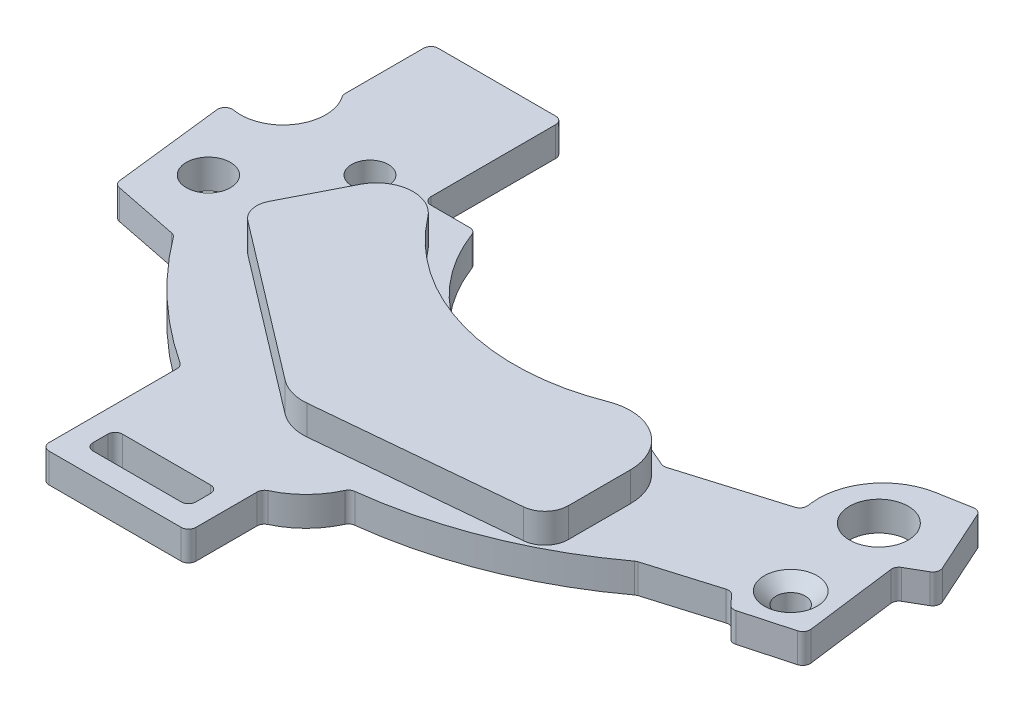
ISO-10303-21;
HEADER;
FILE_DESCRIPTION(('STEP AP214'),'2;1');
FILE_NAME('part.step','',(''),(''),'','','');
FILE_SCHEMA(('AUTOMOTIVE_DESIGN { 1 0 10303 214 1 1 1 1 }'));
ENDSEC;
DATA;
#1=APPLICATION_CONTEXT('core data for automotive mechanical design processes');
#2=APPLICATION_PROTOCOL_DEFINITION('international standard','automotive_design',2000,#1);
#3=PRODUCT_CONTEXT('',#1,'mechanical');
#4=PRODUCT('Part','Part','',(#3));
#5=PRODUCT_RELATED_PRODUCT_CATEGORY('part','',(#4));
#6=PRODUCT_DEFINITION_FORMATION('','',#4);
#7=PRODUCT_DEFINITION_CONTEXT('part definition',#1,'design');
#8=PRODUCT_DEFINITION('design','',#6,#7);
#9=PRODUCT_DEFINITION_SHAPE('','',#8);
#10=(LENGTH_UNIT() NAMED_UNIT(*) SI_UNIT(.MILLI.,.METRE.));
#11=(NAMED_UNIT(*) PLANE_ANGLE_UNIT() SI_UNIT($,.RADIAN.));
#12=(NAMED_UNIT(*) SI_UNIT($,.STERADIAN.) SOLID_ANGLE_UNIT());
#13=UNCERTAINTY_MEASURE_WITH_UNIT(LENGTH_MEASURE(1.E-05),#10,'distance_accuracy_value','');
#14=(GEOMETRIC_REPRESENTATION_CONTEXT(3) GLOBAL_UNCERTAINTY_ASSIGNED_CONTEXT((#13)) GLOBAL_UNIT_ASSIGNED_CONTEXT((#10,
#11,#12)) REPRESENTATION_CONTEXT('',''));
#15=CARTESIAN_POINT('',(0.,0.,0.));
#16=DIRECTION('',(0.,0.,1.));
#17=DIRECTION('',(1.,0.,0.));
#18=AXIS2_PLACEMENT_3D('',#15,#16,#17);
#19=CARTESIAN_POINT('',(-8.11634193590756,2.,-28.404669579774));
#20=DIRECTION('',(0.,1.,0.));
#21=DIRECTION('',(0.,0.,1.));
#22=AXIS2_PLACEMENT_3D('',#19,#20,#21);
#23=PLANE('',#22);
#24=CARTESIAN_POINT('',(-8.,2.,-22.));
#25=DIRECTION('',(0.,1.,0.));
#26=DIRECTION('',(0.,0.,1.));
#27=AXIS2_PLACEMENT_3D('',#24,#25,#26);
#28=CIRCLE('',#27,1.80000000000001);
#29=CARTESIAN_POINT('',(-8.,2.,-20.2));
#30=VERTEX_POINT('',#29);
#31=EDGE_CURVE('E11',#30,#30,#28,.F.);
#32=ORIENTED_EDGE('',*,*,#31,.T.);
#33=EDGE_LOOP('',(#32));
#34=FACE_BOUND('',#33,.T.);
#35=CARTESIAN_POINT('',(-52.35,2.,-26.7));
#36=DIRECTION('',(0.,1.,0.));
#37=DIRECTION('',(0.,0.,1.));
#38=AXIS2_PLACEMENT_3D('',#35,#36,#37);
#39=CIRCLE('',#38,1.5);
#40=CARTESIAN_POINT('',(-52.35,2.,-25.2));
#41=VERTEX_POINT('',#40);
#42=EDGE_CURVE('E523',#41,#41,#39,.T.);
#43=ORIENTED_EDGE('',*,*,#42,.F.);
#44=EDGE_LOOP('',(#43));
#45=FACE_BOUND('',#44,.T.);
#46=CARTESIAN_POINT('',(-46.85,2.,-32.2));
#47=DIRECTION('',(0.,1.,0.));
#48=DIRECTION('',(0.,0.,1.));
#49=AXIS2_PLACEMENT_3D('',#46,#47,#48);
#50=CIRCLE('',#49,1.25);
#51=CARTESIAN_POINT('',(-46.85,2.,-30.95));
#52=VERTEX_POINT('',#51);
#53=EDGE_CURVE('E489',#52,#52,#50,.T.);
#54=ORIENTED_EDGE('',*,*,#53,.F.);
#55=EDGE_LOOP('',(#54));
#56=FACE_BOUND('',#55,.T.);
#57=CARTESIAN_POINT('',(-40.,2.,-8.));
#58=DIRECTION('',(0.,1.,0.));
#59=DIRECTION('',(0.,0.,1.));
#60=AXIS2_PLACEMENT_3D('',#57,#58,#59);
#61=CIRCLE('',#60,0.5);
#62=CARTESIAN_POINT('',(-40.,2.,-8.5));
#63=VERTEX_POINT('',#62);
#64=CARTESIAN_POINT('',(-40.5,2.,-7.99999999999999));
#65=VERTEX_POINT('',#64);
#66=EDGE_CURVE('E62',#63,#65,#61,.T.);
#67=ORIENTED_EDGE('',*,*,#66,.F.);
#68=DIRECTION('',(-1.,0.,0.));
#69=VECTOR('',#68,1.);
#70=CARTESIAN_POINT('',(-40.,2.,-8.5));
#71=LINE('',#70,#69);
#72=CARTESIAN_POINT('',(-34.,2.,-8.5));
#73=VERTEX_POINT('',#72);
#74=EDGE_CURVE('E470',#73,#63,#71,.T.);
#75=ORIENTED_EDGE('',*,*,#74,.F.);
#76=CARTESIAN_POINT('',(-34.,2.,-8.));
#77=DIRECTION('',(0.,1.,0.));
#78=DIRECTION('',(0.,0.,-1.));
#79=AXIS2_PLACEMENT_3D('',#76,#77,#78);
#80=CIRCLE('',#79,0.5);
#81=CARTESIAN_POINT('',(-33.5,2.,-8.));
#82=VERTEX_POINT('',#81);
#83=EDGE_CURVE('E476',#82,#73,#80,.T.);
#84=ORIENTED_EDGE('',*,*,#83,.F.);
#85=DIRECTION('',(0.,0.,-1.));
#86=VECTOR('',#85,1.);
#87=CARTESIAN_POINT('',(-33.5,2.,-8.));
#88=LINE('',#87,#86);
#89=CARTESIAN_POINT('',(-33.5,2.,-7.));
#90=VERTEX_POINT('',#89);
#91=EDGE_CURVE('E2214',#90,#82,#88,.T.);
#92=ORIENTED_EDGE('',*,*,#91,.F.);
#93=CARTESIAN_POINT('',(-34.,2.,-7.));
#94=DIRECTION('',(0.,1.,0.));
#95=DIRECTION('',(0.,0.,1.));
#96=AXIS2_PLACEMENT_3D('',#93,#94,#95);
#97=CIRCLE('',#96,0.5);
#98=CARTESIAN_POINT('',(-34.,2.,-6.5));
#99=VERTEX_POINT('',#98);
#100=EDGE_CURVE('E2218',#99,#90,#97,.T.);
#101=ORIENTED_EDGE('',*,*,#100,.F.);
#102=DIRECTION('',(1.,0.,0.));
#103=VECTOR('',#102,1.);
#104=CARTESIAN_POINT('',(-40.,2.,-6.5));
#105=LINE('',#104,#103);
#106=CARTESIAN_POINT('',(-40.,2.,-6.5));
#107=VERTEX_POINT('',#106);
#108=EDGE_CURVE('E2222',#107,#99,#105,.T.);
#109=ORIENTED_EDGE('',*,*,#108,.F.);
#110=CARTESIAN_POINT('',(-40.,2.,-7.));
#111=DIRECTION('',(0.,1.,0.));
#112=DIRECTION('',(0.,0.,1.));
#113=AXIS2_PLACEMENT_3D('',#110,#111,#112);
#114=CIRCLE('',#113,0.5);
#115=CARTESIAN_POINT('',(-40.5,2.,-7.));
#116=VERTEX_POINT('',#115);
#117=EDGE_CURVE('E491',#116,#107,#114,.T.);
#118=ORIENTED_EDGE('',*,*,#117,.F.);
#119=DIRECTION('',(0.,0.,1.));
#120=VECTOR('',#119,1.);
#121=CARTESIAN_POINT('',(-40.5,2.,-8.));
#122=LINE('',#121,#120);
#123=EDGE_CURVE('E482',#65,#116,#122,.T.);
#124=ORIENTED_EDGE('',*,*,#123,.F.);
#125=EDGE_LOOP('',(#67,#75,#84,#92,#101,#109,#118,#124));
#126=FACE_BOUND('',#125,.T.);
#127=CARTESIAN_POINT('',(-9.,2.,-29.));
#128=DIRECTION('',(0.,1.,0.));
#129=DIRECTION('',(0.,0.,1.));
#130=AXIS2_PLACEMENT_3D('',#127,#128,#129);
#131=CIRCLE('',#130,2.);
#132=CARTESIAN_POINT('',(-9.,2.,-27.));
#133=VERTEX_POINT('',#132);
#134=EDGE_CURVE('E527',#133,#133,#131,.T.);
#135=ORIENTED_EDGE('',*,*,#134,.F.);
#136=EDGE_LOOP('',(#135));
#137=FACE_BOUND('',#136,.T.);
#138=CARTESIAN_POINT('',(-8.11634193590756,2.,-28.404669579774));
#139=DIRECTION('',(0.,1.,0.));
#140=DIRECTION('',(0.,0.,1.));
#141=AXIS2_PLACEMENT_3D('',#138,#139,#140);
#142=CIRCLE('',#141,4.39999999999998);
#143=CARTESIAN_POINT('',(-8.89205797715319,2.,-32.7357508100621));
#144=VERTEX_POINT('',#143);
#145=CARTESIAN_POINT('',(-12.4823645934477,2.,-27.8589167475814));
#146=VERTEX_POINT('',#145);
#147=EDGE_CURVE('E645',#144,#146,#142,.T.);
#148=ORIENTED_EDGE('',*,*,#147,.T.);
#149=DIRECTION('',(0.124034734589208,0.,0.992277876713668));
#150=VECTOR('',#149,1.);
#151=CARTESIAN_POINT('',(-12.4523658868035,2.,-27.618927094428));
#152=LINE('',#151,#150);
#153=CARTESIAN_POINT('',(-12.4523658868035,2.,-27.618927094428));
#154=VERTEX_POINT('',#153);
#155=EDGE_CURVE('E649',#146,#154,#152,.T.);
#156=ORIENTED_EDGE('',*,*,#155,.T.);
#157=CARTESIAN_POINT('',(-12.9485048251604,2.,-27.5569097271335));
#158=DIRECTION('',(0.,-1.,0.));
#159=DIRECTION('',(0.,0.,-1.));
#160=AXIS2_PLACEMENT_3D('',#157,#158,#159);
#161=CIRCLE('',#160,0.500000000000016);
#162=CARTESIAN_POINT('',(-12.8042293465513,2.,-27.0781774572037));
#163=VERTEX_POINT('',#162);
#164=EDGE_CURVE('E653',#154,#163,#161,.T.);
#165=ORIENTED_EDGE('',*,*,#164,.T.);
#166=DIRECTION('',(-0.957464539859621,0.,0.288550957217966));
#167=VECTOR('',#166,1.);
#168=CARTESIAN_POINT('',(-19.524478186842,2.,-25.0528969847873));
#169=LINE('',#168,#167);
#170=CARTESIAN_POINT('',(-19.524478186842,2.,-25.0528969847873));
#171=VERTEX_POINT('',#170);
#172=EDGE_CURVE('E656',#163,#171,#169,.T.);
#173=ORIENTED_EDGE('',*,*,#172,.T.);
#174=CARTESIAN_POINT('',(-19.668753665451,2.,-25.5316292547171));
#175=DIRECTION('',(0.,-1.,0.));
#176=DIRECTION('',(0.,0.,1.));
#177=AXIS2_PLACEMENT_3D('',#174,#175,#176);
#178=CIRCLE('',#177,0.500000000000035);
#179=CARTESIAN_POINT('',(-19.8681167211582,2.,-25.0730942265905));
#180=VERTEX_POINT('',#179);
#181=EDGE_CURVE('E659',#171,#180,#178,.T.);
#182=ORIENTED_EDGE('',*,*,#181,.T.);
#183=DIRECTION('',(-0.917070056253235,0.,-0.398726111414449));
#184=VECTOR('',#183,1.);
#185=CARTESIAN_POINT('',(-19.8681167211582,2.,-25.0730942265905));
#186=LINE('',#185,#184);
#187=CARTESIAN_POINT('',(-21.094376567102,2.,-25.6062506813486));
#188=VERTEX_POINT('',#187);
#189=EDGE_CURVE('E662',#180,#188,#186,.T.);
#190=ORIENTED_EDGE('',*,*,#189,.T.);
#191=CARTESIAN_POINT('',(-21.8918287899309,2.,-23.7721105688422));
#192=DIRECTION('',(0.,1.,0.));
#193=DIRECTION('',(0.,0.,1.));
#194=AXIS2_PLACEMENT_3D('',#191,#192,#193);
#195=CIRCLE('',#194,2.);
#196=CARTESIAN_POINT('',(-22.7999115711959,2.,-25.5540717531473));
#197=VERTEX_POINT('',#196);
#198=EDGE_CURVE('E665',#188,#197,#195,.T.);
#199=ORIENTED_EDGE('',*,*,#198,.T.);
#200=CARTESIAN_POINT('',(-28.3802787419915,2.,-36.504612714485));
#201=DIRECTION('',(0.,-1.,0.));
#202=DIRECTION('',(0.,0.,1.));
#203=AXIS2_PLACEMENT_3D('',#200,#201,#202);
#204=CIRCLE('',#203,12.2904371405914);
#205=CARTESIAN_POINT('',(-39.8832680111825,2.,-32.1760929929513));
#206=VERTEX_POINT('',#205);
#207=EDGE_CURVE('E668',#197,#206,#204,.T.);
#208=ORIENTED_EDGE('',*,*,#207,.T.);
#209=CARTESIAN_POINT('',(-40.3512330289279,2.,-32.));
#210=DIRECTION('',(0.,1.,0.));
#211=DIRECTION('',(0.,0.,-1.));
#212=AXIS2_PLACEMENT_3D('',#209,#210,#211);
#213=CIRCLE('',#212,0.499999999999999);
#214=CARTESIAN_POINT('',(-40.3512330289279,2.,-32.5));
#215=VERTEX_POINT('',#214);
#216=EDGE_CURVE('E671',#206,#215,#213,.T.);
#217=ORIENTED_EDGE('',*,*,#216,.T.);
#218=DIRECTION('',(-1.,0.,0.));
#219=VECTOR('',#218,1.);
#220=CARTESIAN_POINT('',(-43.,2.,-32.5));
#221=LINE('',#220,#219);
#222=CARTESIAN_POINT('',(-43.,2.,-32.5));
#223=VERTEX_POINT('',#222);
#224=EDGE_CURVE('E674',#215,#223,#221,.T.);
#225=ORIENTED_EDGE('',*,*,#224,.T.);
#226=CARTESIAN_POINT('',(-43.,2.,-33.));
#227=DIRECTION('',(0.,-1.,0.));
#228=DIRECTION('',(0.,0.,1.));
#229=AXIS2_PLACEMENT_3D('',#226,#227,#228);
#230=CIRCLE('',#229,0.5);
#231=CARTESIAN_POINT('',(-43.5,2.,-33.));
#232=VERTEX_POINT('',#231);
#233=EDGE_CURVE('E677',#223,#232,#230,.T.);
#234=ORIENTED_EDGE('',*,*,#233,.T.);
#235=DIRECTION('',(0.,0.,-1.));
#236=VECTOR('',#235,1.);
#237=CARTESIAN_POINT('',(-43.5,2.,-41.5));
#238=LINE('',#237,#236);
#239=CARTESIAN_POINT('',(-43.5,2.,-41.5));
#240=VERTEX_POINT('',#239);
#241=EDGE_CURVE('E680',#232,#240,#238,.T.);
#242=ORIENTED_EDGE('',*,*,#241,.T.);
#243=CARTESIAN_POINT('',(-44.,2.,-41.5));
#244=DIRECTION('',(0.,1.,0.));
#245=DIRECTION('',(0.,0.,-1.));
#246=AXIS2_PLACEMENT_3D('',#243,#244,#245);
#247=CIRCLE('',#246,0.5);
#248=CARTESIAN_POINT('',(-44.,2.,-42.));
#249=VERTEX_POINT('',#248);
#250=EDGE_CURVE('E683',#240,#249,#247,.T.);
#251=ORIENTED_EDGE('',*,*,#250,.T.);
#252=DIRECTION('',(-1.,0.,0.));
#253=VECTOR('',#252,1.);
#254=CARTESIAN_POINT('',(-52.,2.,-42.));
#255=LINE('',#254,#253);
#256=CARTESIAN_POINT('',(-52.,2.,-42.));
#257=VERTEX_POINT('',#256);
#258=EDGE_CURVE('E686',#249,#257,#255,.T.);
#259=ORIENTED_EDGE('',*,*,#258,.T.);
#260=CARTESIAN_POINT('',(-52.,2.,-41.5));
#261=DIRECTION('',(0.,1.,0.));
#262=DIRECTION('',(0.,0.,-1.));
#263=AXIS2_PLACEMENT_3D('',#260,#261,#262);
#264=CIRCLE('',#263,0.5);
#265=CARTESIAN_POINT('',(-52.5,2.,-41.5));
#266=VERTEX_POINT('',#265);
#267=EDGE_CURVE('E689',#257,#266,#264,.T.);
#268=ORIENTED_EDGE('',*,*,#267,.T.);
#269=DIRECTION('',(0.,0.,1.));
#270=VECTOR('',#269,1.);
#271=CARTESIAN_POINT('',(-52.5,2.,-41.5));
#272=LINE('',#271,#270);
#273=CARTESIAN_POINT('',(-52.5,2.,-36.1612508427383));
#274=VERTEX_POINT('',#273);
#275=EDGE_CURVE('E692',#266,#274,#272,.T.);
#276=ORIENTED_EDGE('',*,*,#275,.T.);
#277=CARTESIAN_POINT('',(-52.,2.,-36.1612508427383));
#278=DIRECTION('',(0.,1.,0.));
#279=DIRECTION('',(0.,0.,1.));
#280=AXIS2_PLACEMENT_3D('',#277,#278,#279);
#281=CIRCLE('',#280,0.500000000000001);
#282=CARTESIAN_POINT('',(-52.4128702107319,2.,-35.8792256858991));
#283=VERTEX_POINT('',#282);
#284=EDGE_CURVE('E695',#274,#283,#281,.T.);
#285=ORIENTED_EDGE('',*,*,#284,.T.);
#286=CARTESIAN_POINT('',(-54.8075174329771,2.,-34.2434797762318));
#287=DIRECTION('',(0.,-1.,0.));
#288=DIRECTION('',(0.,0.,-1.));
#289=AXIS2_PLACEMENT_3D('',#286,#287,#288);
#290=CIRCLE('',#289,2.9);
#291=CARTESIAN_POINT('',(-55.3256863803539,2.,-31.3901482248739));
#292=VERTEX_POINT('',#291);
#293=EDGE_CURVE('E698',#283,#292,#290,.T.);
#294=ORIENTED_EDGE('',*,*,#293,.T.);
#295=CARTESIAN_POINT('',(-55.4150258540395,2.,-30.8981945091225));
#296=DIRECTION('',(0.,1.,0.));
#297=DIRECTION('',(0.,0.,1.));
#298=AXIS2_PLACEMENT_3D('',#295,#296,#297);
#299=CIRCLE('',#298,0.5);
#300=CARTESIAN_POINT('',(-55.9116795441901,2.,-30.8404440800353));
#301=VERTEX_POINT('',#300);
#302=EDGE_CURVE('E701',#292,#301,#299,.T.);
#303=ORIENTED_EDGE('',*,*,#302,.T.);
#304=DIRECTION('',(0.115500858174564,0.,0.993307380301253));
#305=VECTOR('',#304,1.);
#306=CARTESIAN_POINT('',(-55.9116795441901,2.,-30.8404440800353));
#307=LINE('',#306,#305);
#308=CARTESIAN_POINT('',(-55.0420024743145,2.,-23.3612212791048));
#309=VERTEX_POINT('',#308);
#310=EDGE_CURVE('E704',#301,#309,#307,.T.);
#311=ORIENTED_EDGE('',*,*,#310,.T.);
#312=CARTESIAN_POINT('',(-54.5453487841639,2.,-23.4189717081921));
#313=DIRECTION('',(0.,1.,0.));
#314=DIRECTION('',(0.,0.,1.));
#315=AXIS2_PLACEMENT_3D('',#312,#313,#314);
#316=CIRCLE('',#315,0.500000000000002);
#317=CARTESIAN_POINT('',(-54.643406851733,2.,-22.9286813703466));
#318=VERTEX_POINT('',#317);
#319=EDGE_CURVE('E707',#309,#318,#316,.T.);
#320=ORIENTED_EDGE('',*,*,#319,.T.);
#321=DIRECTION('',(0.98058067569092,0.,0.196116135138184));
#322=VECTOR('',#321,1.);
#323=CARTESIAN_POINT('',(-54.643406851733,2.,-22.9286813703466));
#324=LINE('',#323,#322);
#325=CARTESIAN_POINT('',(-50.1881235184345,2.,-22.0376247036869));
#326=VERTEX_POINT('',#325);
#327=EDGE_CURVE('E710',#318,#326,#324,.T.);
#328=ORIENTED_EDGE('',*,*,#327,.T.);
#329=CARTESIAN_POINT('',(-50.2861815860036,2.,-21.5473343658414));
#330=DIRECTION('',(0.,-1.,0.));
#331=DIRECTION('',(0.,0.,-1.));
#332=AXIS2_PLACEMENT_3D('',#329,#330,#331);
#333=CIRCLE('',#332,0.49999999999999);
#334=CARTESIAN_POINT('',(-49.8862556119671,2.,-21.8474330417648));
#335=VERTEX_POINT('',#334);
#336=EDGE_CURVE('E713',#326,#335,#333,.T.);
#337=ORIENTED_EDGE('',*,*,#336,.T.);
#338=CARTESIAN_POINT('',(-25.4055889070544,2.,-40.2173718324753));
#339=DIRECTION('',(0.,1.,0.));
#340=DIRECTION('',(0.,0.,1.));
#341=AXIS2_PLACEMENT_3D('',#338,#339,#340);
#342=CIRCLE('',#341,30.6064975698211);
#343=CARTESIAN_POINT('',(-42.2252276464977,2.,-14.646735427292));
#344=VERTEX_POINT('',#343);
#345=EDGE_CURVE('E716',#335,#344,#342,.T.);
#346=ORIENTED_EDGE('',*,*,#345,.T.);
#347=CARTESIAN_POINT('',(-42.5,2.,-14.2290032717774));
#348=DIRECTION('',(0.,-1.,0.));
#349=DIRECTION('',(0.,0.,-1.));
#350=AXIS2_PLACEMENT_3D('',#347,#348,#349);
#351=CIRCLE('',#350,0.499999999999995);
#352=CARTESIAN_POINT('',(-42.,2.,-14.2290032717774));
#353=VERTEX_POINT('',#352);
#354=EDGE_CURVE('E719',#344,#353,#351,.T.);
#355=ORIENTED_EDGE('',*,*,#354,.T.);
#356=DIRECTION('',(0.,0.,1.));
#357=VECTOR('',#356,1.);
#358=CARTESIAN_POINT('',(-42.,2.,-14.2290032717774));
#359=LINE('',#358,#357);
#360=CARTESIAN_POINT('',(-42.,2.,-5.5));
#361=VERTEX_POINT('',#360);
#362=EDGE_CURVE('E722',#353,#361,#359,.T.);
#363=ORIENTED_EDGE('',*,*,#362,.T.);
#364=CARTESIAN_POINT('',(-41.5,2.,-5.5));
#365=DIRECTION('',(0.,1.,0.));
#366=DIRECTION('',(0.,0.,1.));
#367=AXIS2_PLACEMENT_3D('',#364,#365,#366);
#368=CIRCLE('',#367,0.5);
#369=CARTESIAN_POINT('',(-41.5,2.,-5.));
#370=VERTEX_POINT('',#369);
#371=EDGE_CURVE('E725',#361,#370,#368,.T.);
#372=ORIENTED_EDGE('',*,*,#371,.T.);
#373=DIRECTION('',(1.,0.,0.));
#374=VECTOR('',#373,1.);
#375=CARTESIAN_POINT('',(-41.5,2.,-5.));
#376=LINE('',#375,#374);
#377=CARTESIAN_POINT('',(-32.5,2.,-5.));
#378=VERTEX_POINT('',#377);
#379=EDGE_CURVE('E728',#370,#378,#376,.T.);
#380=ORIENTED_EDGE('',*,*,#379,.T.);
#381=CARTESIAN_POINT('',(-32.5,2.,-5.5));
#382=DIRECTION('',(0.,1.,0.));
#383=DIRECTION('',(0.,0.,1.));
#384=AXIS2_PLACEMENT_3D('',#381,#382,#383);
#385=CIRCLE('',#384,0.5);
#386=CARTESIAN_POINT('',(-32.,2.,-5.5));
#387=VERTEX_POINT('',#386);
#388=EDGE_CURVE('E731',#378,#387,#385,.T.);
#389=ORIENTED_EDGE('',*,*,#388,.T.);
#390=DIRECTION('',(0.,0.,-1.));
#391=VECTOR('',#390,1.);
#392=CARTESIAN_POINT('',(-32.,2.,-5.5));
#393=LINE('',#392,#391);
#394=CARTESIAN_POINT('',(-32.,2.,-9.67124953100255));
#395=VERTEX_POINT('',#394);
#396=EDGE_CURVE('E734',#387,#395,#393,.T.);
#397=ORIENTED_EDGE('',*,*,#396,.T.);
#398=CARTESIAN_POINT('',(-31.5,2.,-9.67124953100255));
#399=DIRECTION('',(0.,-1.,0.));
#400=DIRECTION('',(0.,0.,-1.));
#401=AXIS2_PLACEMENT_3D('',#398,#399,#400);
#402=CIRCLE('',#401,0.5);
#403=CARTESIAN_POINT('',(-31.7112848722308,2.,-10.1244147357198));
#404=VERTEX_POINT('',#403);
#405=EDGE_CURVE('E737',#395,#404,#402,.T.);
#406=ORIENTED_EDGE('',*,*,#405,.T.);
#407=CARTESIAN_POINT('',(-33.9709416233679,2.,-14.9709416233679));
#408=DIRECTION('',(0.,1.,0.));
#409=DIRECTION('',(0.,0.,1.));
#410=AXIS2_PLACEMENT_3D('',#407,#408,#409);
#411=CIRCLE('',#410,5.34741727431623);
#412=CARTESIAN_POINT('',(-29.1091717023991,2.,-12.744270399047));
#413=VERTEX_POINT('',#412);
#414=EDGE_CURVE('E740',#404,#413,#411,.T.);
#415=ORIENTED_EDGE('',*,*,#414,.T.);
#416=CARTESIAN_POINT('',(-28.6545812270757,2.,-12.5360697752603));
#417=DIRECTION('',(0.,-1.,0.));
#418=DIRECTION('',(0.,0.,1.));
#419=AXIS2_PLACEMENT_3D('',#416,#417,#418);
#420=CIRCLE('',#419,0.499999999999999);
#421=CARTESIAN_POINT('',(-28.7135887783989,2.,-13.0325756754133));
#422=VERTEX_POINT('',#421);
#423=EDGE_CURVE('E743',#413,#422,#420,.T.);
#424=ORIENTED_EDGE('',*,*,#423,.T.);
#425=CARTESIAN_POINT('',(-32.088466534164,2.,-41.4297329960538));
#426=DIRECTION('',(0.,1.,0.));
#427=DIRECTION('',(0.,0.,1.));
#428=AXIS2_PLACEMENT_3D('',#425,#426,#427);
#429=CIRCLE('',#428,28.5969988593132);
#430=CARTESIAN_POINT('',(-15.0698339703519,2.,-18.4481210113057));
#431=VERTEX_POINT('',#430);
#432=EDGE_CURVE('E746',#422,#431,#429,.T.);
#433=ORIENTED_EDGE('',*,*,#432,.T.);
#434=CARTESIAN_POINT('',(-14.7722742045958,2.,-18.0463024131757));
#435=DIRECTION('',(0.,-1.,0.));
#436=DIRECTION('',(0.,0.,1.));
#437=AXIS2_PLACEMENT_3D('',#434,#435,#436);
#438=CIRCLE('',#437,0.499999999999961);
#439=CARTESIAN_POINT('',(-14.915948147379,2.,-18.5252155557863));
#440=VERTEX_POINT('',#439);
#441=EDGE_CURVE('E749',#431,#440,#438,.T.);
#442=ORIENTED_EDGE('',*,*,#441,.T.);
#443=DIRECTION('',(0.957826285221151,0.,-0.287347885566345));
#444=VECTOR('',#443,1.);
#445=CARTESIAN_POINT('',(-14.915948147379,2.,-18.5252155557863));
#446=LINE('',#445,#444);
#447=CARTESIAN_POINT('',(-10.3017368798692,2.,-19.9094789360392));
#448=VERTEX_POINT('',#447);
#449=EDGE_CURVE('E752',#440,#448,#446,.T.);
#450=ORIENTED_EDGE('',*,*,#449,.T.);
#451=CARTESIAN_POINT('',(-10.158062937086,2.,-19.4305657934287));
#452=DIRECTION('',(0.,-1.,0.));
#453=DIRECTION('',(0.,0.,-1.));
#454=AXIS2_PLACEMENT_3D('',#451,#452,#453);
#455=CIRCLE('',#454,0.49999999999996);
#456=CARTESIAN_POINT('',(-9.78809290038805,2.,-19.7669021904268));
#457=VERTEX_POINT('',#456);
#458=EDGE_CURVE('E755',#448,#457,#455,.T.);
#459=ORIENTED_EDGE('',*,*,#458,.T.);
#460=DIRECTION('',(0.672672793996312,0.,0.739940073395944));
#461=VECTOR('',#460,1.);
#462=CARTESIAN_POINT('',(-9.78809290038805,2.,-19.7669021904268));
#463=LINE('',#462,#461);
#464=CARTESIAN_POINT('',(-9.2065215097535,2.,-19.1271736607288));
#465=VERTEX_POINT('',#464);
#466=EDGE_CURVE('E758',#457,#465,#463,.T.);
#467=ORIENTED_EDGE('',*,*,#466,.T.);
#468=CARTESIAN_POINT('',(-8.83655147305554,2.,-19.463510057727));
#469=DIRECTION('',(0.,1.,0.));
#470=DIRECTION('',(0.,0.,1.));
#471=AXIS2_PLACEMENT_3D('',#468,#469,#470);
#472=CIRCLE('',#471,0.500000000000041);
#473=CARTESIAN_POINT('',(-8.70397323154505,2.,-18.9814073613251));
#474=VERTEX_POINT('',#473);
#475=EDGE_CURVE('E761',#465,#474,#472,.T.);
#476=ORIENTED_EDGE('',*,*,#475,.T.);
#477=DIRECTION('',(0.96420539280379,0.,-0.265156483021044));
#478=VECTOR('',#477,1.);
#479=CARTESIAN_POINT('',(-8.70397323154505,2.,-18.9814073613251));
#480=LINE('',#479,#478);
#481=CARTESIAN_POINT('',(-5.41871745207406,2.,-19.8848527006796));
#482=VERTEX_POINT('',#481);
#483=EDGE_CURVE('E764',#474,#482,#480,.T.);
#484=ORIENTED_EDGE('',*,*,#483,.T.);
#485=CARTESIAN_POINT('',(-5.5512956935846,2.,-20.3669553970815));
#486=DIRECTION('',(0.,1.,0.));
#487=DIRECTION('',(0.,0.,-1.));
#488=AXIS2_PLACEMENT_3D('',#485,#486,#487);
#489=CIRCLE('',#488,0.500000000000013);
#490=CARTESIAN_POINT('',(-5.05537780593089,2.,-20.4307162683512));
#491=VERTEX_POINT('',#490);
#492=EDGE_CURVE('E767',#482,#491,#489,.T.);
#493=ORIENTED_EDGE('',*,*,#492,.T.);
#494=DIRECTION('',(-0.127521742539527,0.,-0.991835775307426));
#495=VECTOR('',#494,1.);
#496=CARTESIAN_POINT('',(-5.8575909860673,2.,-26.6701521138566));
#497=LINE('',#496,#495);
#498=CARTESIAN_POINT('',(-5.85759098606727,2.,-26.6701521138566));
#499=VERTEX_POINT('',#498);
#500=EDGE_CURVE('E770',#491,#499,#497,.T.);
#501=ORIENTED_EDGE('',*,*,#500,.T.);
#502=CARTESIAN_POINT('',(-5.36167309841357,2.,-26.7339129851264));
#503=DIRECTION('',(0.,-1.,0.));
#504=DIRECTION('',(0.,0.,-1.));
#505=AXIS2_PLACEMENT_3D('',#502,#503,#504);
#506=CIRCLE('',#505,0.499999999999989);
#507=CARTESIAN_POINT('',(-5.61219123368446,2.,-27.1666261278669));
#508=VERTEX_POINT('',#507);
#509=EDGE_CURVE('E773',#499,#508,#506,.T.);
#510=ORIENTED_EDGE('',*,*,#509,.T.);
#511=DIRECTION('',(0.865426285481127,0.,-0.501036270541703));
#512=VECTOR('',#511,1.);
#513=CARTESIAN_POINT('',(-5.61219123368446,2.,-27.1666261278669));
#514=LINE('',#513,#512);
#515=CARTESIAN_POINT('',(-4.39102651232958,2.,-27.8736162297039));
#516=VERTEX_POINT('',#515);
#517=EDGE_CURVE('E776',#508,#516,#514,.T.);
#518=ORIENTED_EDGE('',*,*,#517,.T.);
#519=CARTESIAN_POINT('',(-4.64154464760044,2.,-28.3063293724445));
#520=DIRECTION('',(0.,1.,0.));
#521=DIRECTION('',(0.,0.,1.));
#522=AXIS2_PLACEMENT_3D('',#519,#520,#521);
#523=CIRCLE('',#522,0.500000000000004);
#524=CARTESIAN_POINT('',(-4.18575126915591,2.,-28.5118832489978));
#525=VERTEX_POINT('',#524);
#526=EDGE_CURVE('E779',#516,#525,#523,.T.);
#527=ORIENTED_EDGE('',*,*,#526,.T.);
#528=DIRECTION('',(-0.411107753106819,0.,-0.911586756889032));
#529=VECTOR('',#528,1.);
#530=CARTESIAN_POINT('',(-4.18575126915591,2.,-28.5118832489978));
#531=LINE('',#530,#529);
#532=CARTESIAN_POINT('',(-6.13975057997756,2.,-32.8446643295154));
#533=VERTEX_POINT('',#532);
#534=EDGE_CURVE('E782',#525,#533,#531,.T.);
#535=ORIENTED_EDGE('',*,*,#534,.T.);
#536=CARTESIAN_POINT('',(-6.59554395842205,2.,-32.639110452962));
#537=DIRECTION('',(0.,1.,0.));
#538=DIRECTION('',(0.,0.,1.));
#539=AXIS2_PLACEMENT_3D('',#536,#537,#538);
#540=CIRCLE('',#539,0.499999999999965);
#541=CARTESIAN_POINT('',(-6.68369350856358,2.,-33.1312787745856));
#542=VERTEX_POINT('',#541);
#543=EDGE_CURVE('E785',#533,#542,#540,.T.);
#544=ORIENTED_EDGE('',*,*,#543,.T.);
#545=DIRECTION('',(-0.984336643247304,0.,0.176299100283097));
#546=VECTOR('',#545,1.);
#547=CARTESIAN_POINT('',(-8.89205797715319,2.,-32.7357508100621));
#548=LINE('',#547,#546);
#549=EDGE_CURVE('E788',#542,#144,#548,.T.);
#550=ORIENTED_EDGE('',*,*,#549,.T.);
#551=EDGE_LOOP('',(#148,#156,#165,#173,#182,#190,#199,#208,#217,#225,#234,#242,#251,#259,#268,
#276,#285,#294,#303,#311,#320,#328,#337,#346,#355,#363,#372,#380,#389,#397,#406,#415,#424,#433,
#442,#450,#459,#467,#476,#484,#493,#501,#510,#518,#527,#535,#544,#550));
#552=FACE_BOUND('',#551,.T.);
#553=DIRECTION('',(-0.454777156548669,0.,0.890605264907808));
#554=VECTOR('',#553,1.);
#555=CARTESIAN_POINT('',(-46.7301603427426,2.,-25.2159359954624));
#556=LINE('',#555,#554);
#557=CARTESIAN_POINT('',(-44.6290602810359,2.,-29.3305902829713));
#558=VERTEX_POINT('',#557);
#559=CARTESIAN_POINT('',(-46.7301603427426,2.,-25.2159359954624));
#560=VERTEX_POINT('',#559);
#561=EDGE_CURVE('E580',#558,#560,#556,.T.);
#562=ORIENTED_EDGE('',*,*,#561,.F.);
#563=CARTESIAN_POINT('',(-42.4025471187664,2.,-28.1936473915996));
#564=DIRECTION('',(0.,1.,0.));
#565=DIRECTION('',(0.,0.,-1.));
#566=AXIS2_PLACEMENT_3D('',#563,#564,#565);
#567=CIRCLE('',#566,2.5);
#568=CARTESIAN_POINT('',(-40.4139060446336,2.,-29.7086743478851));
#569=VERTEX_POINT('',#568);
#570=EDGE_CURVE('E540',#569,#558,#567,.T.);
#571=ORIENTED_EDGE('',*,*,#570,.F.);
#572=CARTESIAN_POINT('',(-28.7436125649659,2.,-38.5995744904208));
#573=DIRECTION('',(0.,-1.,0.));
#574=DIRECTION('',(0.,0.,1.));
#575=AXIS2_PLACEMENT_3D('',#572,#573,#574);
#576=CIRCLE('',#575,14.6711913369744);
#577=CARTESIAN_POINT('',(-23.3796433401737,2.,-24.9441107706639));
#578=VERTEX_POINT('',#577);
#579=EDGE_CURVE('E549',#578,#569,#576,.T.);
#580=ORIENTED_EDGE('',*,*,#579,.F.);
#581=CARTESIAN_POINT('',(-22.1,2.,-21.6864255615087));
#582=DIRECTION('',(0.,1.,0.));
#583=DIRECTION('',(0.,0.,1.));
#584=AXIS2_PLACEMENT_3D('',#581,#582,#583);
#585=CIRCLE('',#584,3.5);
#586=CARTESIAN_POINT('',(-18.6,2.,-21.6864255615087));
#587=VERTEX_POINT('',#586);
#588=EDGE_CURVE('E601',#587,#578,#585,.T.);
#589=ORIENTED_EDGE('',*,*,#588,.F.);
#590=DIRECTION('',(0.,0.,-1.));
#591=VECTOR('',#590,1.);
#592=CARTESIAN_POINT('',(-18.6,2.,-21.6864255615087));
#593=LINE('',#592,#591);
#594=CARTESIAN_POINT('',(-18.6,2.,-17.4578608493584));
#595=VERTEX_POINT('',#594);
#596=EDGE_CURVE('E598',#595,#587,#593,.T.);
#597=ORIENTED_EDGE('',*,*,#596,.F.);
#598=CARTESIAN_POINT('',(-20.2,2.,-17.4578608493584));
#599=DIRECTION('',(0.,1.,0.));
#600=DIRECTION('',(0.,0.,1.));
#601=AXIS2_PLACEMENT_3D('',#598,#599,#600);
#602=CIRCLE('',#601,1.6);
#603=CARTESIAN_POINT('',(-20.051574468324,2.,-15.8647601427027));
#604=VERTEX_POINT('',#603);
#605=EDGE_CURVE('E595',#604,#595,#602,.T.);
#606=ORIENTED_EDGE('',*,*,#605,.F.);
#607=DIRECTION('',(0.995687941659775,0.,-0.0927659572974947));
#608=VECTOR('',#607,1.);
#609=CARTESIAN_POINT('',(-33.534590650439,2.,-14.6085785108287));
#610=LINE('',#609,#608);
#611=CARTESIAN_POINT('',(-33.534590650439,2.,-14.6085785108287));
#612=VERTEX_POINT('',#611);
#613=EDGE_CURVE('E592',#612,#604,#610,.T.);
#614=ORIENTED_EDGE('',*,*,#613,.F.);
#615=CARTESIAN_POINT('',(-33.8128885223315,2.,-17.595642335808));
#616=DIRECTION('',(0.,1.,0.));
#617=DIRECTION('',(0.,0.,1.));
#618=AXIS2_PLACEMENT_3D('',#615,#616,#617);
#619=CIRCLE('',#618,3.);
#620=CARTESIAN_POINT('',(-35.63101816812,2.,-15.2093471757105));
#621=VERTEX_POINT('',#620);
#622=EDGE_CURVE('E589',#621,#612,#619,.T.);
#623=ORIENTED_EDGE('',*,*,#622,.F.);
#624=DIRECTION('',(0.795431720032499,0.,0.606043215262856));
#625=VECTOR('',#624,1.);
#626=CARTESIAN_POINT('',(-35.63101816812,2.,-15.2093471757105));
#627=LINE('',#626,#625);
#628=CARTESIAN_POINT('',(-46.3033172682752,2.,-23.3406226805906));
#629=VERTEX_POINT('',#628);
#630=EDGE_CURVE('E586',#629,#621,#627,.T.);
#631=ORIENTED_EDGE('',*,*,#630,.F.);
#632=CARTESIAN_POINT('',(-45.3942524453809,2.,-24.5337702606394));
#633=DIRECTION('',(0.,1.,0.));
#634=DIRECTION('',(0.,0.,1.));
#635=AXIS2_PLACEMENT_3D('',#632,#633,#634);
#636=CIRCLE('',#635,1.5);
#637=EDGE_CURVE('E583',#560,#629,#636,.T.);
#638=ORIENTED_EDGE('',*,*,#637,.F.);
#639=EDGE_LOOP('',(#562,#571,#580,#589,#597,#606,#614,#623,#631,#638));
#640=FACE_BOUND('',#639,.T.);
#641=ADVANCED_FACE('F45',(#34,#45,#56,#126,#137,#552,#640),#23,.T.);
#642=CARTESIAN_POINT('',(-8.11634193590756,2.,-28.404669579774));
#643=DIRECTION('',(0.,-1.,0.));
#644=DIRECTION('',(0.,0.,-1.));
#645=AXIS2_PLACEMENT_3D('',#642,#643,#644);
#646=CYLINDRICAL_SURFACE('',#645,4.39999999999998);
#647=CARTESIAN_POINT('',(-8.11634193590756,0.,-28.404669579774));
#648=DIRECTION('',(0.,1.,0.));
#649=DIRECTION('',(0.,0.,1.));
#650=AXIS2_PLACEMENT_3D('',#647,#648,#649);
#651=CIRCLE('',#650,4.39999999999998);
#652=CARTESIAN_POINT('',(-8.89205797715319,0.,-32.7357508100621));
#653=VERTEX_POINT('',#652);
#654=CARTESIAN_POINT('',(-12.4823645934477,0.,-27.8589167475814));
#655=VERTEX_POINT('',#654);
#656=EDGE_CURVE('E644',#653,#655,#651,.T.);
#657=ORIENTED_EDGE('',*,*,#656,.T.);
#658=DIRECTION('',(0.,-1.,0.));
#659=VECTOR('',#658,1.);
#660=CARTESIAN_POINT('',(-12.4823645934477,2.,-27.8589167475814));
#661=LINE('',#660,#659);
#662=EDGE_CURVE('E1122',#146,#655,#661,.T.);
#663=ORIENTED_EDGE('',*,*,#662,.F.);
#664=ORIENTED_EDGE('',*,*,#147,.F.);
#665=DIRECTION('',(0.,-1.,0.));
#666=VECTOR('',#665,1.);
#667=CARTESIAN_POINT('',(-8.89205797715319,2.,-32.7357508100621));
#668=LINE('',#667,#666);
#669=EDGE_CURVE('E791',#144,#653,#668,.T.);
#670=ORIENTED_EDGE('',*,*,#669,.T.);
#671=EDGE_LOOP('',(#657,#663,#664,#670));
#672=FACE_BOUND('',#671,.T.);
#673=ADVANCED_FACE('F1142',(#672),#646,.T.);
#674=CARTESIAN_POINT('',(-12.4523658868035,2.,-27.618927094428));
#675=DIRECTION('',(0.992277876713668,0.,-0.124034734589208));
#676=DIRECTION('',(-0.124034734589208,0.,-0.992277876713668));
#677=AXIS2_PLACEMENT_3D('',#674,#675,#676);
#678=PLANE('',#677);
#679=DIRECTION('',(0.124034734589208,0.,0.992277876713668));
#680=VECTOR('',#679,1.);
#681=CARTESIAN_POINT('',(-12.4523658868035,0.,-27.618927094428));
#682=LINE('',#681,#680);
#683=CARTESIAN_POINT('',(-12.4523658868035,0.,-27.618927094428));
#684=VERTEX_POINT('',#683);
#685=EDGE_CURVE('E795',#655,#684,#682,.T.);
#686=ORIENTED_EDGE('',*,*,#685,.T.);
#687=DIRECTION('',(0.,-1.,0.));
#688=VECTOR('',#687,1.);
#689=CARTESIAN_POINT('',(-12.4523658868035,2.,-27.618927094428));
#690=LINE('',#689,#688);
#691=EDGE_CURVE('E1118',#154,#684,#690,.T.);
#692=ORIENTED_EDGE('',*,*,#691,.F.);
#693=ORIENTED_EDGE('',*,*,#155,.F.);
#694=ORIENTED_EDGE('',*,*,#662,.T.);
#695=EDGE_LOOP('',(#686,#692,#693,#694));
#696=FACE_BOUND('',#695,.T.);
#697=ADVANCED_FACE('F1148',(#696),#678,.F.);
#698=CARTESIAN_POINT('',(-12.9485048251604,2.,-27.5569097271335));
#699=DIRECTION('',(0.,-1.,0.));
#700=DIRECTION('',(0.,0.,-1.));
#701=AXIS2_PLACEMENT_3D('',#698,#699,#700);
#702=CYLINDRICAL_SURFACE('',#701,0.500000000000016);
#703=CARTESIAN_POINT('',(-12.9485048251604,0.,-27.5569097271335));
#704=DIRECTION('',(0.,-1.,0.));
#705=DIRECTION('',(0.,0.,-1.));
#706=AXIS2_PLACEMENT_3D('',#703,#704,#705);
#707=CIRCLE('',#706,0.500000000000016);
#708=CARTESIAN_POINT('',(-12.8042293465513,0.,-27.0781774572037));
#709=VERTEX_POINT('',#708);
#710=EDGE_CURVE('E798',#684,#709,#707,.T.);
#711=ORIENTED_EDGE('',*,*,#710,.T.);
#712=DIRECTION('',(0.,-1.,0.));
#713=VECTOR('',#712,1.);
#714=CARTESIAN_POINT('',(-12.8042293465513,2.,-27.0781774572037));
#715=LINE('',#714,#713);
#716=EDGE_CURVE('E1114',#163,#709,#715,.T.);
#717=ORIENTED_EDGE('',*,*,#716,.F.);
#718=ORIENTED_EDGE('',*,*,#164,.F.);
#719=ORIENTED_EDGE('',*,*,#691,.T.);
#720=EDGE_LOOP('',(#711,#717,#718,#719));
#721=FACE_BOUND('',#720,.T.);
#722=ADVANCED_FACE('F1338',(#721),#702,.F.);
#723=CARTESIAN_POINT('',(-19.524478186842,2.,-25.0528969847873));
#724=DIRECTION('',(0.288550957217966,0.,0.957464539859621));
#725=DIRECTION('',(0.957464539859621,0.,-0.288550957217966));
#726=AXIS2_PLACEMENT_3D('',#723,#724,#725);
#727=PLANE('',#726);
#728=DIRECTION('',(-0.957464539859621,0.,0.288550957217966));
#729=VECTOR('',#728,1.);
#730=CARTESIAN_POINT('',(-19.524478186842,0.,-25.0528969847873));
#731=LINE('',#730,#729);
#732=CARTESIAN_POINT('',(-19.524478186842,0.,-25.0528969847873));
#733=VERTEX_POINT('',#732);
#734=EDGE_CURVE('E801',#709,#733,#731,.T.);
#735=ORIENTED_EDGE('',*,*,#734,.T.);
#736=DIRECTION('',(0.,-1.,0.));
#737=VECTOR('',#736,1.);
#738=CARTESIAN_POINT('',(-19.524478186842,2.,-25.0528969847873));
#739=LINE('',#738,#737);
#740=EDGE_CURVE('E1110',#171,#733,#739,.T.);
#741=ORIENTED_EDGE('',*,*,#740,.F.);
#742=ORIENTED_EDGE('',*,*,#172,.F.);
#743=ORIENTED_EDGE('',*,*,#716,.T.);
#744=EDGE_LOOP('',(#735,#741,#742,#743));
#745=FACE_BOUND('',#744,.T.);
#746=ADVANCED_FACE('F1334',(#745),#727,.F.);
#747=CARTESIAN_POINT('',(-19.668753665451,2.,-25.5316292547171));
#748=DIRECTION('',(0.,-1.,0.));
#749=DIRECTION('',(0.,0.,-1.));
#750=AXIS2_PLACEMENT_3D('',#747,#748,#749);
#751=CYLINDRICAL_SURFACE('',#750,0.500000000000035);
#752=CARTESIAN_POINT('',(-19.668753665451,0.,-25.5316292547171));
#753=DIRECTION('',(0.,-1.,0.));
#754=DIRECTION('',(0.,0.,1.));
#755=AXIS2_PLACEMENT_3D('',#752,#753,#754);
#756=CIRCLE('',#755,0.500000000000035);
#757=CARTESIAN_POINT('',(-19.8681167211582,0.,-25.0730942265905));
#758=VERTEX_POINT('',#757);
#759=EDGE_CURVE('E804',#733,#758,#756,.T.);
#760=ORIENTED_EDGE('',*,*,#759,.T.);
#761=DIRECTION('',(0.,-1.,0.));
#762=VECTOR('',#761,1.);
#763=CARTESIAN_POINT('',(-19.8681167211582,2.,-25.0730942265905));
#764=LINE('',#763,#762);
#765=EDGE_CURVE('E1106',#180,#758,#764,.T.);
#766=ORIENTED_EDGE('',*,*,#765,.F.);
#767=ORIENTED_EDGE('',*,*,#181,.F.);
#768=ORIENTED_EDGE('',*,*,#740,.T.);
#769=EDGE_LOOP('',(#760,#766,#767,#768));
#770=FACE_BOUND('',#769,.T.);
#771=ADVANCED_FACE('F1330',(#770),#751,.F.);
#772=CARTESIAN_POINT('',(-19.8681167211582,2.,-25.0730942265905));
#773=DIRECTION('',(-0.398726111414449,0.,0.917070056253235));
#774=DIRECTION('',(0.917070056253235,0.,0.398726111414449));
#775=AXIS2_PLACEMENT_3D('',#772,#773,#774);
#776=PLANE('',#775);
#777=DIRECTION('',(-0.917070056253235,0.,-0.398726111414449));
#778=VECTOR('',#777,1.);
#779=CARTESIAN_POINT('',(-19.8681167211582,0.,-25.0730942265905));
#780=LINE('',#779,#778);
#781=CARTESIAN_POINT('',(-21.094376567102,0.,-25.6062506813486));
#782=VERTEX_POINT('',#781);
#783=EDGE_CURVE('E807',#758,#782,#780,.T.);
#784=ORIENTED_EDGE('',*,*,#783,.T.);
#785=DIRECTION('',(0.,-1.,0.));
#786=VECTOR('',#785,1.);
#787=CARTESIAN_POINT('',(-21.094376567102,2.,-25.6062506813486));
#788=LINE('',#787,#786);
#789=EDGE_CURVE('E1102',#188,#782,#788,.T.);
#790=ORIENTED_EDGE('',*,*,#789,.F.);
#791=ORIENTED_EDGE('',*,*,#189,.F.);
#792=ORIENTED_EDGE('',*,*,#765,.T.);
#793=EDGE_LOOP('',(#784,#790,#791,#792));
#794=FACE_BOUND('',#793,.T.);
#795=ADVANCED_FACE('F1326',(#794),#776,.F.);
#796=CARTESIAN_POINT('',(-21.8918287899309,2.,-23.7721105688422));
#797=DIRECTION('',(0.,-1.,0.));
#798=DIRECTION('',(0.,0.,-1.));
#799=AXIS2_PLACEMENT_3D('',#796,#797,#798);
#800=CYLINDRICAL_SURFACE('',#799,2.);
#801=CARTESIAN_POINT('',(-21.8918287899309,0.,-23.7721105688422));
#802=DIRECTION('',(0.,1.,0.));
#803=DIRECTION('',(0.,0.,1.));
#804=AXIS2_PLACEMENT_3D('',#801,#802,#803);
#805=CIRCLE('',#804,2.);
#806=CARTESIAN_POINT('',(-22.7999115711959,0.,-25.5540717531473));
#807=VERTEX_POINT('',#806);
#808=EDGE_CURVE('E810',#782,#807,#805,.T.);
#809=ORIENTED_EDGE('',*,*,#808,.T.);
#810=DIRECTION('',(0.,-1.,0.));
#811=VECTOR('',#810,1.);
#812=CARTESIAN_POINT('',(-22.7999115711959,2.,-25.5540717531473));
#813=LINE('',#812,#811);
#814=EDGE_CURVE('E1098',#197,#807,#813,.T.);
#815=ORIENTED_EDGE('',*,*,#814,.F.);
#816=ORIENTED_EDGE('',*,*,#198,.F.);
#817=ORIENTED_EDGE('',*,*,#789,.T.);
#818=EDGE_LOOP('',(#809,#815,#816,#817));
#819=FACE_BOUND('',#818,.T.);
#820=ADVANCED_FACE('F1322',(#819),#800,.T.);
#821=CARTESIAN_POINT('',(-28.3802787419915,2.,-36.504612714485));
#822=DIRECTION('',(0.,-1.,0.));
#823=DIRECTION('',(0.,0.,-1.));
#824=AXIS2_PLACEMENT_3D('',#821,#822,#823);
#825=CYLINDRICAL_SURFACE('',#824,12.2904371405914);
#826=CARTESIAN_POINT('',(-28.3802787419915,0.,-36.504612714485));
#827=DIRECTION('',(0.,-1.,0.));
#828=DIRECTION('',(0.,0.,1.));
#829=AXIS2_PLACEMENT_3D('',#826,#827,#828);
#830=CIRCLE('',#829,12.2904371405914);
#831=CARTESIAN_POINT('',(-39.8832680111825,0.,-32.1760929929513));
#832=VERTEX_POINT('',#831);
#833=EDGE_CURVE('E813',#807,#832,#830,.T.);
#834=ORIENTED_EDGE('',*,*,#833,.T.);
#835=DIRECTION('',(0.,-1.,0.));
#836=VECTOR('',#835,1.);
#837=CARTESIAN_POINT('',(-39.8832680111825,2.,-32.1760929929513));
#838=LINE('',#837,#836);
#839=EDGE_CURVE('E1094',#206,#832,#838,.T.);
#840=ORIENTED_EDGE('',*,*,#839,.F.);
#841=ORIENTED_EDGE('',*,*,#207,.F.);
#842=ORIENTED_EDGE('',*,*,#814,.T.);
#843=EDGE_LOOP('',(#834,#840,#841,#842));
#844=FACE_BOUND('',#843,.T.);
#845=ADVANCED_FACE('F1318',(#844),#825,.F.);
#846=CARTESIAN_POINT('',(-40.3512330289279,2.,-32.));
#847=DIRECTION('',(0.,-1.,0.));
#848=DIRECTION('',(0.,0.,-1.));
#849=AXIS2_PLACEMENT_3D('',#846,#847,#848);
#850=CYLINDRICAL_SURFACE('',#849,0.499999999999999);
#851=CARTESIAN_POINT('',(-40.3512330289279,0.,-32.));
#852=DIRECTION('',(0.,1.,0.));
#853=DIRECTION('',(0.,0.,-1.));
#854=AXIS2_PLACEMENT_3D('',#851,#852,#853);
#855=CIRCLE('',#854,0.499999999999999);
#856=CARTESIAN_POINT('',(-40.3512330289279,0.,-32.5));
#857=VERTEX_POINT('',#856);
#858=EDGE_CURVE('E816',#832,#857,#855,.T.);
#859=ORIENTED_EDGE('',*,*,#858,.T.);
#860=DIRECTION('',(0.,-1.,0.));
#861=VECTOR('',#860,1.);
#862=CARTESIAN_POINT('',(-40.3512330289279,2.,-32.5));
#863=LINE('',#862,#861);
#864=EDGE_CURVE('E1090',#215,#857,#863,.T.);
#865=ORIENTED_EDGE('',*,*,#864,.F.);
#866=ORIENTED_EDGE('',*,*,#216,.F.);
#867=ORIENTED_EDGE('',*,*,#839,.T.);
#868=EDGE_LOOP('',(#859,#865,#866,#867));
#869=FACE_BOUND('',#868,.T.);
#870=ADVANCED_FACE('F1314',(#869),#850,.T.);
#871=CARTESIAN_POINT('',(-43.,2.,-32.5));
#872=DIRECTION('',(0.,0.,1.));
#873=DIRECTION('',(1.,0.,0.));
#874=AXIS2_PLACEMENT_3D('',#871,#872,#873);
#875=PLANE('',#874);
#876=DIRECTION('',(-1.,0.,0.));
#877=VECTOR('',#876,1.);
#878=CARTESIAN_POINT('',(-43.,0.,-32.5));
#879=LINE('',#878,#877);
#880=CARTESIAN_POINT('',(-43.,0.,-32.5));
#881=VERTEX_POINT('',#880);
#882=EDGE_CURVE('E819',#857,#881,#879,.T.);
#883=ORIENTED_EDGE('',*,*,#882,.T.);
#884=DIRECTION('',(0.,-1.,0.));
#885=VECTOR('',#884,1.);
#886=CARTESIAN_POINT('',(-43.,2.,-32.5));
#887=LINE('',#886,#885);
#888=EDGE_CURVE('E1086',#223,#881,#887,.T.);
#889=ORIENTED_EDGE('',*,*,#888,.F.);
#890=ORIENTED_EDGE('',*,*,#224,.F.);
#891=ORIENTED_EDGE('',*,*,#864,.T.);
#892=EDGE_LOOP('',(#883,#889,#890,#891));
#893=FACE_BOUND('',#892,.T.);
#894=ADVANCED_FACE('F1310',(#893),#875,.F.);
#895=CARTESIAN_POINT('',(-43.,2.,-33.));
#896=DIRECTION('',(0.,-1.,0.));
#897=DIRECTION('',(0.,0.,-1.));
#898=AXIS2_PLACEMENT_3D('',#895,#896,#897);
#899=CYLINDRICAL_SURFACE('',#898,0.5);
#900=CARTESIAN_POINT('',(-43.,0.,-33.));
#901=DIRECTION('',(0.,-1.,0.));
#902=DIRECTION('',(0.,0.,1.));
#903=AXIS2_PLACEMENT_3D('',#900,#901,#902);
#904=CIRCLE('',#903,0.5);
#905=CARTESIAN_POINT('',(-43.5,0.,-33.));
#906=VERTEX_POINT('',#905);
#907=EDGE_CURVE('E822',#881,#906,#904,.T.);
#908=ORIENTED_EDGE('',*,*,#907,.T.);
#909=DIRECTION('',(0.,-1.,0.));
#910=VECTOR('',#909,1.);
#911=CARTESIAN_POINT('',(-43.5,2.,-33.));
#912=LINE('',#911,#910);
#913=EDGE_CURVE('E1082',#232,#906,#912,.T.);
#914=ORIENTED_EDGE('',*,*,#913,.F.);
#915=ORIENTED_EDGE('',*,*,#233,.F.);
#916=ORIENTED_EDGE('',*,*,#888,.T.);
#917=EDGE_LOOP('',(#908,#914,#915,#916));
#918=FACE_BOUND('',#917,.T.);
#919=ADVANCED_FACE('F1306',(#918),#899,.F.);
#920=CARTESIAN_POINT('',(-43.5,2.,-41.5));
#921=DIRECTION('',(-1.,0.,0.));
#922=DIRECTION('',(0.,0.,1.));
#923=AXIS2_PLACEMENT_3D('',#920,#921,#922);
#924=PLANE('',#923);
#925=DIRECTION('',(0.,0.,-1.));
#926=VECTOR('',#925,1.);
#927=CARTESIAN_POINT('',(-43.5,0.,-41.5));
#928=LINE('',#927,#926);
#929=CARTESIAN_POINT('',(-43.5,0.,-41.5));
#930=VERTEX_POINT('',#929);
#931=EDGE_CURVE('E825',#906,#930,#928,.T.);
#932=ORIENTED_EDGE('',*,*,#931,.T.);
#933=DIRECTION('',(0.,-1.,0.));
#934=VECTOR('',#933,1.);
#935=CARTESIAN_POINT('',(-43.5,2.,-41.5));
#936=LINE('',#935,#934);
#937=EDGE_CURVE('E1078',#240,#930,#936,.T.);
#938=ORIENTED_EDGE('',*,*,#937,.F.);
#939=ORIENTED_EDGE('',*,*,#241,.F.);
#940=ORIENTED_EDGE('',*,*,#913,.T.);
#941=EDGE_LOOP('',(#932,#938,#939,#940));
#942=FACE_BOUND('',#941,.T.);
#943=ADVANCED_FACE('F1302',(#942),#924,.F.);
#944=CARTESIAN_POINT('',(-44.,2.,-41.5));
#945=DIRECTION('',(0.,-1.,0.));
#946=DIRECTION('',(0.,0.,-1.));
#947=AXIS2_PLACEMENT_3D('',#944,#945,#946);
#948=CYLINDRICAL_SURFACE('',#947,0.5);
#949=CARTESIAN_POINT('',(-44.,0.,-41.5));
#950=DIRECTION('',(0.,1.,0.));
#951=DIRECTION('',(0.,0.,-1.));
#952=AXIS2_PLACEMENT_3D('',#949,#950,#951);
#953=CIRCLE('',#952,0.5);
#954=CARTESIAN_POINT('',(-44.,0.,-42.));
#955=VERTEX_POINT('',#954);
#956=EDGE_CURVE('E828',#930,#955,#953,.T.);
#957=ORIENTED_EDGE('',*,*,#956,.T.);
#958=DIRECTION('',(0.,-1.,0.));
#959=VECTOR('',#958,1.);
#960=CARTESIAN_POINT('',(-44.,2.,-42.));
#961=LINE('',#960,#959);
#962=EDGE_CURVE('E1074',#249,#955,#961,.T.);
#963=ORIENTED_EDGE('',*,*,#962,.F.);
#964=ORIENTED_EDGE('',*,*,#250,.F.);
#965=ORIENTED_EDGE('',*,*,#937,.T.);
#966=EDGE_LOOP('',(#957,#963,#964,#965));
#967=FACE_BOUND('',#966,.T.);
#968=ADVANCED_FACE('F1298',(#967),#948,.T.);
#969=CARTESIAN_POINT('',(-52.,2.,-42.));
#970=DIRECTION('',(0.,0.,1.));
#971=DIRECTION('',(1.,0.,0.));
#972=AXIS2_PLACEMENT_3D('',#969,#970,#971);
#973=PLANE('',#972);
#974=DIRECTION('',(-1.,0.,0.));
#975=VECTOR('',#974,1.);
#976=CARTESIAN_POINT('',(-52.,0.,-42.));
#977=LINE('',#976,#975);
#978=CARTESIAN_POINT('',(-52.,0.,-42.));
#979=VERTEX_POINT('',#978);
#980=EDGE_CURVE('E831',#955,#979,#977,.T.);
#981=ORIENTED_EDGE('',*,*,#980,.T.);
#982=DIRECTION('',(0.,-1.,0.));
#983=VECTOR('',#982,1.);
#984=CARTESIAN_POINT('',(-52.,2.,-42.));
#985=LINE('',#984,#983);
#986=EDGE_CURVE('E1070',#257,#979,#985,.T.);
#987=ORIENTED_EDGE('',*,*,#986,.F.);
#988=ORIENTED_EDGE('',*,*,#258,.F.);
#989=ORIENTED_EDGE('',*,*,#962,.T.);
#990=EDGE_LOOP('',(#981,#987,#988,#989));
#991=FACE_BOUND('',#990,.T.);
#992=ADVANCED_FACE('F1294',(#991),#973,.F.);
#993=CARTESIAN_POINT('',(-52.,2.,-41.5));
#994=DIRECTION('',(0.,-1.,0.));
#995=DIRECTION('',(0.,0.,-1.));
#996=AXIS2_PLACEMENT_3D('',#993,#994,#995);
#997=CYLINDRICAL_SURFACE('',#996,0.5);
#998=CARTESIAN_POINT('',(-52.,0.,-41.5));
#999=DIRECTION('',(0.,1.,0.));
#1000=DIRECTION('',(0.,0.,-1.));
#1001=AXIS2_PLACEMENT_3D('',#998,#999,#1000);
#1002=CIRCLE('',#1001,0.5);
#1003=CARTESIAN_POINT('',(-52.5,0.,-41.5));
#1004=VERTEX_POINT('',#1003);
#1005=EDGE_CURVE('E834',#979,#1004,#1002,.T.);
#1006=ORIENTED_EDGE('',*,*,#1005,.T.);
#1007=DIRECTION('',(0.,-1.,0.));
#1008=VECTOR('',#1007,1.);
#1009=CARTESIAN_POINT('',(-52.5,2.,-41.5));
#1010=LINE('',#1009,#1008);
#1011=EDGE_CURVE('E1066',#266,#1004,#1010,.T.);
#1012=ORIENTED_EDGE('',*,*,#1011,.F.);
#1013=ORIENTED_EDGE('',*,*,#267,.F.);
#1014=ORIENTED_EDGE('',*,*,#986,.T.);
#1015=EDGE_LOOP('',(#1006,#1012,#1013,#1014));
#1016=FACE_BOUND('',#1015,.T.);
#1017=ADVANCED_FACE('F1290',(#1016),#997,.T.);
#1018=CARTESIAN_POINT('',(-52.5,2.,-41.5));
#1019=DIRECTION('',(1.,0.,0.));
#1020=DIRECTION('',(0.,0.,-1.));
#1021=AXIS2_PLACEMENT_3D('',#1018,#1019,#1020);
#1022=PLANE('',#1021);
#1023=DIRECTION('',(0.,0.,1.));
#1024=VECTOR('',#1023,1.);
#1025=CARTESIAN_POINT('',(-52.5,0.,-41.5));
#1026=LINE('',#1025,#1024);
#1027=CARTESIAN_POINT('',(-52.5,0.,-36.1612508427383));
#1028=VERTEX_POINT('',#1027);
#1029=EDGE_CURVE('E837',#1004,#1028,#1026,.T.);
#1030=ORIENTED_EDGE('',*,*,#1029,.T.);
#1031=DIRECTION('',(0.,-1.,0.));
#1032=VECTOR('',#1031,1.);
#1033=CARTESIAN_POINT('',(-52.5,2.,-36.1612508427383));
#1034=LINE('',#1033,#1032);
#1035=EDGE_CURVE('E1062',#274,#1028,#1034,.T.);
#1036=ORIENTED_EDGE('',*,*,#1035,.F.);
#1037=ORIENTED_EDGE('',*,*,#275,.F.);
#1038=ORIENTED_EDGE('',*,*,#1011,.T.);
#1039=EDGE_LOOP('',(#1030,#1036,#1037,#1038));
#1040=FACE_BOUND('',#1039,.T.);
#1041=ADVANCED_FACE('F1286',(#1040),#1022,.F.);
#1042=CARTESIAN_POINT('',(-52.,2.,-36.1612508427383));
#1043=DIRECTION('',(0.,-1.,0.));
#1044=DIRECTION('',(0.,0.,-1.));
#1045=AXIS2_PLACEMENT_3D('',#1042,#1043,#1044);
#1046=CYLINDRICAL_SURFACE('',#1045,0.500000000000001);
#1047=CARTESIAN_POINT('',(-52.,0.,-36.1612508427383));
#1048=DIRECTION('',(0.,1.,0.));
#1049=DIRECTION('',(0.,0.,1.));
#1050=AXIS2_PLACEMENT_3D('',#1047,#1048,#1049);
#1051=CIRCLE('',#1050,0.500000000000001);
#1052=CARTESIAN_POINT('',(-52.4128702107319,0.,-35.8792256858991));
#1053=VERTEX_POINT('',#1052);
#1054=EDGE_CURVE('E840',#1028,#1053,#1051,.T.);
#1055=ORIENTED_EDGE('',*,*,#1054,.T.);
#1056=DIRECTION('',(0.,-1.,0.));
#1057=VECTOR('',#1056,1.);
#1058=CARTESIAN_POINT('',(-52.4128702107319,2.,-35.8792256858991));
#1059=LINE('',#1058,#1057);
#1060=EDGE_CURVE('E1058',#283,#1053,#1059,.T.);
#1061=ORIENTED_EDGE('',*,*,#1060,.F.);
#1062=ORIENTED_EDGE('',*,*,#284,.F.);
#1063=ORIENTED_EDGE('',*,*,#1035,.T.);
#1064=EDGE_LOOP('',(#1055,#1061,#1062,#1063));
#1065=FACE_BOUND('',#1064,.T.);
#1066=ADVANCED_FACE('F1282',(#1065),#1046,.T.);
#1067=CARTESIAN_POINT('',(-54.8075174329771,2.,-34.2434797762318));
#1068=DIRECTION('',(0.,-1.,0.));
#1069=DIRECTION('',(0.,0.,-1.));
#1070=AXIS2_PLACEMENT_3D('',#1067,#1068,#1069);
#1071=CYLINDRICAL_SURFACE('',#1070,2.9);
#1072=CARTESIAN_POINT('',(-54.8075174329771,0.,-34.2434797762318));
#1073=DIRECTION('',(0.,-1.,0.));
#1074=DIRECTION('',(0.,0.,-1.));
#1075=AXIS2_PLACEMENT_3D('',#1072,#1073,#1074);
#1076=CIRCLE('',#1075,2.9);
#1077=CARTESIAN_POINT('',(-55.3256863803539,0.,-31.3901482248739));
#1078=VERTEX_POINT('',#1077);
#1079=EDGE_CURVE('E843',#1053,#1078,#1076,.T.);
#1080=ORIENTED_EDGE('',*,*,#1079,.T.);
#1081=DIRECTION('',(0.,-1.,0.));
#1082=VECTOR('',#1081,1.);
#1083=CARTESIAN_POINT('',(-55.3256863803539,2.,-31.3901482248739));
#1084=LINE('',#1083,#1082);
#1085=EDGE_CURVE('E1054',#292,#1078,#1084,.T.);
#1086=ORIENTED_EDGE('',*,*,#1085,.F.);
#1087=ORIENTED_EDGE('',*,*,#293,.F.);
#1088=ORIENTED_EDGE('',*,*,#1060,.T.);
#1089=EDGE_LOOP('',(#1080,#1086,#1087,#1088));
#1090=FACE_BOUND('',#1089,.T.);
#1091=ADVANCED_FACE('F1278',(#1090),#1071,.F.);
#1092=CARTESIAN_POINT('',(-55.4150258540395,2.,-30.8981945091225));
#1093=DIRECTION('',(0.,-1.,0.));
#1094=DIRECTION('',(0.,0.,-1.));
#1095=AXIS2_PLACEMENT_3D('',#1092,#1093,#1094);
#1096=CYLINDRICAL_SURFACE('',#1095,0.5);
#1097=CARTESIAN_POINT('',(-55.4150258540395,0.,-30.8981945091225));
#1098=DIRECTION('',(0.,1.,0.));
#1099=DIRECTION('',(0.,0.,1.));
#1100=AXIS2_PLACEMENT_3D('',#1097,#1098,#1099);
#1101=CIRCLE('',#1100,0.5);
#1102=CARTESIAN_POINT('',(-55.9116795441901,0.,-30.8404440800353));
#1103=VERTEX_POINT('',#1102);
#1104=EDGE_CURVE('E846',#1078,#1103,#1101,.T.);
#1105=ORIENTED_EDGE('',*,*,#1104,.T.);
#1106=DIRECTION('',(0.,-1.,0.));
#1107=VECTOR('',#1106,1.);
#1108=CARTESIAN_POINT('',(-55.9116795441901,2.,-30.8404440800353));
#1109=LINE('',#1108,#1107);
#1110=EDGE_CURVE('E1050',#301,#1103,#1109,.T.);
#1111=ORIENTED_EDGE('',*,*,#1110,.F.);
#1112=ORIENTED_EDGE('',*,*,#302,.F.);
#1113=ORIENTED_EDGE('',*,*,#1085,.T.);
#1114=EDGE_LOOP('',(#1105,#1111,#1112,#1113));
#1115=FACE_BOUND('',#1114,.T.);
#1116=ADVANCED_FACE('F1274',(#1115),#1096,.T.);
#1117=CARTESIAN_POINT('',(-55.9116795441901,2.,-30.8404440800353));
#1118=DIRECTION('',(0.993307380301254,0.,-0.115500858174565));
#1119=DIRECTION('',(-0.115500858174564,0.,-0.993307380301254));
#1120=AXIS2_PLACEMENT_3D('',#1117,#1118,#1119);
#1121=PLANE('',#1120);
#1122=DIRECTION('',(0.115500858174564,0.,0.993307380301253));
#1123=VECTOR('',#1122,1.);
#1124=CARTESIAN_POINT('',(-55.9116795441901,0.,-30.8404440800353));
#1125=LINE('',#1124,#1123);
#1126=CARTESIAN_POINT('',(-55.0420024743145,0.,-23.3612212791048));
#1127=VERTEX_POINT('',#1126);
#1128=EDGE_CURVE('E849',#1103,#1127,#1125,.T.);
#1129=ORIENTED_EDGE('',*,*,#1128,.T.);
#1130=DIRECTION('',(0.,-1.,0.));
#1131=VECTOR('',#1130,1.);
#1132=CARTESIAN_POINT('',(-55.0420024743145,2.,-23.3612212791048));
#1133=LINE('',#1132,#1131);
#1134=EDGE_CURVE('E1046',#309,#1127,#1133,.T.);
#1135=ORIENTED_EDGE('',*,*,#1134,.F.);
#1136=ORIENTED_EDGE('',*,*,#310,.F.);
#1137=ORIENTED_EDGE('',*,*,#1110,.T.);
#1138=EDGE_LOOP('',(#1129,#1135,#1136,#1137));
#1139=FACE_BOUND('',#1138,.T.);
#1140=ADVANCED_FACE('F1270',(#1139),#1121,.F.);
#1141=CARTESIAN_POINT('',(-54.5453487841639,2.,-23.4189717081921));
#1142=DIRECTION('',(0.,-1.,0.));
#1143=DIRECTION('',(0.,0.,-1.));
#1144=AXIS2_PLACEMENT_3D('',#1141,#1142,#1143);
#1145=CYLINDRICAL_SURFACE('',#1144,0.500000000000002);
#1146=CARTESIAN_POINT('',(-54.5453487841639,0.,-23.4189717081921));
#1147=DIRECTION('',(0.,1.,0.));
#1148=DIRECTION('',(0.,0.,1.));
#1149=AXIS2_PLACEMENT_3D('',#1146,#1147,#1148);
#1150=CIRCLE('',#1149,0.500000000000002);
#1151=CARTESIAN_POINT('',(-54.643406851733,0.,-22.9286813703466));
#1152=VERTEX_POINT('',#1151);
#1153=EDGE_CURVE('E852',#1127,#1152,#1150,.T.);
#1154=ORIENTED_EDGE('',*,*,#1153,.T.);
#1155=DIRECTION('',(0.,-1.,0.));
#1156=VECTOR('',#1155,1.);
#1157=CARTESIAN_POINT('',(-54.643406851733,2.,-22.9286813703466));
#1158=LINE('',#1157,#1156);
#1159=EDGE_CURVE('E1042',#318,#1152,#1158,.T.);
#1160=ORIENTED_EDGE('',*,*,#1159,.F.);
#1161=ORIENTED_EDGE('',*,*,#319,.F.);
#1162=ORIENTED_EDGE('',*,*,#1134,.T.);
#1163=EDGE_LOOP('',(#1154,#1160,#1161,#1162));
#1164=FACE_BOUND('',#1163,.T.);
#1165=ADVANCED_FACE('F1266',(#1164),#1145,.T.);
#1166=CARTESIAN_POINT('',(-54.643406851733,2.,-22.9286813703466));
#1167=DIRECTION('',(0.196116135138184,0.,-0.98058067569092));
#1168=DIRECTION('',(-0.98058067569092,0.,-0.196116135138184));
#1169=AXIS2_PLACEMENT_3D('',#1166,#1167,#1168);
#1170=PLANE('',#1169);
#1171=DIRECTION('',(0.98058067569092,0.,0.196116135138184));
#1172=VECTOR('',#1171,1.);
#1173=CARTESIAN_POINT('',(-54.643406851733,0.,-22.9286813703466));
#1174=LINE('',#1173,#1172);
#1175=CARTESIAN_POINT('',(-50.1881235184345,0.,-22.0376247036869));
#1176=VERTEX_POINT('',#1175);
#1177=EDGE_CURVE('E855',#1152,#1176,#1174,.T.);
#1178=ORIENTED_EDGE('',*,*,#1177,.T.);
#1179=DIRECTION('',(0.,-1.,0.));
#1180=VECTOR('',#1179,1.);
#1181=CARTESIAN_POINT('',(-50.1881235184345,2.,-22.0376247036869));
#1182=LINE('',#1181,#1180);
#1183=EDGE_CURVE('E1038',#326,#1176,#1182,.T.);
#1184=ORIENTED_EDGE('',*,*,#1183,.F.);
#1185=ORIENTED_EDGE('',*,*,#327,.F.);
#1186=ORIENTED_EDGE('',*,*,#1159,.T.);
#1187=EDGE_LOOP('',(#1178,#1184,#1185,#1186));
#1188=FACE_BOUND('',#1187,.T.);
#1189=ADVANCED_FACE('F1262',(#1188),#1170,.F.);
#1190=CARTESIAN_POINT('',(-50.2861815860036,2.,-21.5473343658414));
#1191=DIRECTION('',(0.,-1.,0.));
#1192=DIRECTION('',(0.,0.,-1.));
#1193=AXIS2_PLACEMENT_3D('',#1190,#1191,#1192);
#1194=CYLINDRICAL_SURFACE('',#1193,0.49999999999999);
#1195=CARTESIAN_POINT('',(-50.2861815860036,0.,-21.5473343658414));
#1196=DIRECTION('',(0.,-1.,0.));
#1197=DIRECTION('',(0.,0.,-1.));
#1198=AXIS2_PLACEMENT_3D('',#1195,#1196,#1197);
#1199=CIRCLE('',#1198,0.49999999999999);
#1200=CARTESIAN_POINT('',(-49.8862556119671,0.,-21.8474330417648));
#1201=VERTEX_POINT('',#1200);
#1202=EDGE_CURVE('E858',#1176,#1201,#1199,.T.);
#1203=ORIENTED_EDGE('',*,*,#1202,.T.);
#1204=DIRECTION('',(0.,-1.,0.));
#1205=VECTOR('',#1204,1.);
#1206=CARTESIAN_POINT('',(-49.8862556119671,2.,-21.8474330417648));
#1207=LINE('',#1206,#1205);
#1208=EDGE_CURVE('E1034',#335,#1201,#1207,.T.);
#1209=ORIENTED_EDGE('',*,*,#1208,.F.);
#1210=ORIENTED_EDGE('',*,*,#336,.F.);
#1211=ORIENTED_EDGE('',*,*,#1183,.T.);
#1212=EDGE_LOOP('',(#1203,#1209,#1210,#1211));
#1213=FACE_BOUND('',#1212,.T.);
#1214=ADVANCED_FACE('F1258',(#1213),#1194,.F.);
#1215=CARTESIAN_POINT('',(-25.4055889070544,2.,-40.2173718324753));
#1216=DIRECTION('',(0.,-1.,0.));
#1217=DIRECTION('',(0.,0.,-1.));
#1218=AXIS2_PLACEMENT_3D('',#1215,#1216,#1217);
#1219=CYLINDRICAL_SURFACE('',#1218,30.6064975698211);
#1220=CARTESIAN_POINT('',(-25.4055889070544,0.,-40.2173718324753));
#1221=DIRECTION('',(0.,1.,0.));
#1222=DIRECTION('',(0.,0.,1.));
#1223=AXIS2_PLACEMENT_3D('',#1220,#1221,#1222);
#1224=CIRCLE('',#1223,30.6064975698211);
#1225=CARTESIAN_POINT('',(-42.2252276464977,0.,-14.646735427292));
#1226=VERTEX_POINT('',#1225);
#1227=EDGE_CURVE('E861',#1201,#1226,#1224,.T.);
#1228=ORIENTED_EDGE('',*,*,#1227,.T.);
#1229=DIRECTION('',(0.,-1.,0.));
#1230=VECTOR('',#1229,1.);
#1231=CARTESIAN_POINT('',(-42.2252276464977,2.,-14.646735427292));
#1232=LINE('',#1231,#1230);
#1233=EDGE_CURVE('E1030',#344,#1226,#1232,.T.);
#1234=ORIENTED_EDGE('',*,*,#1233,.F.);
#1235=ORIENTED_EDGE('',*,*,#345,.F.);
#1236=ORIENTED_EDGE('',*,*,#1208,.T.);
#1237=EDGE_LOOP('',(#1228,#1234,#1235,#1236));
#1238=FACE_BOUND('',#1237,.T.);
#1239=ADVANCED_FACE('F1254',(#1238),#1219,.T.);
#1240=CARTESIAN_POINT('',(-42.5,2.,-14.2290032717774));
#1241=DIRECTION('',(0.,-1.,0.));
#1242=DIRECTION('',(0.,0.,-1.));
#1243=AXIS2_PLACEMENT_3D('',#1240,#1241,#1242);
#1244=CYLINDRICAL_SURFACE('',#1243,0.499999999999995);
#1245=CARTESIAN_POINT('',(-42.5,0.,-14.2290032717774));
#1246=DIRECTION('',(0.,-1.,0.));
#1247=DIRECTION('',(0.,0.,-1.));
#1248=AXIS2_PLACEMENT_3D('',#1245,#1246,#1247);
#1249=CIRCLE('',#1248,0.499999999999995);
#1250=CARTESIAN_POINT('',(-42.,0.,-14.2290032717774));
#1251=VERTEX_POINT('',#1250);
#1252=EDGE_CURVE('E864',#1226,#1251,#1249,.T.);
#1253=ORIENTED_EDGE('',*,*,#1252,.T.);
#1254=DIRECTION('',(0.,-1.,0.));
#1255=VECTOR('',#1254,1.);
#1256=CARTESIAN_POINT('',(-42.,2.,-14.2290032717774));
#1257=LINE('',#1256,#1255);
#1258=EDGE_CURVE('E1026',#353,#1251,#1257,.T.);
#1259=ORIENTED_EDGE('',*,*,#1258,.F.);
#1260=ORIENTED_EDGE('',*,*,#354,.F.);
#1261=ORIENTED_EDGE('',*,*,#1233,.T.);
#1262=EDGE_LOOP('',(#1253,#1259,#1260,#1261));
#1263=FACE_BOUND('',#1262,.T.);
#1264=ADVANCED_FACE('F1250',(#1263),#1244,.F.);
#1265=CARTESIAN_POINT('',(-42.,2.,-14.2290032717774));
#1266=DIRECTION('',(1.,0.,0.));
#1267=DIRECTION('',(0.,0.,-1.));
#1268=AXIS2_PLACEMENT_3D('',#1265,#1266,#1267);
#1269=PLANE('',#1268);
#1270=DIRECTION('',(0.,0.,1.));
#1271=VECTOR('',#1270,1.);
#1272=CARTESIAN_POINT('',(-42.,0.,-14.2290032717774));
#1273=LINE('',#1272,#1271);
#1274=CARTESIAN_POINT('',(-42.,0.,-5.5));
#1275=VERTEX_POINT('',#1274);
#1276=EDGE_CURVE('E867',#1251,#1275,#1273,.T.);
#1277=ORIENTED_EDGE('',*,*,#1276,.T.);
#1278=DIRECTION('',(0.,-1.,0.));
#1279=VECTOR('',#1278,1.);
#1280=CARTESIAN_POINT('',(-42.,2.,-5.5));
#1281=LINE('',#1280,#1279);
#1282=EDGE_CURVE('E1022',#361,#1275,#1281,.T.);
#1283=ORIENTED_EDGE('',*,*,#1282,.F.);
#1284=ORIENTED_EDGE('',*,*,#362,.F.);
#1285=ORIENTED_EDGE('',*,*,#1258,.T.);
#1286=EDGE_LOOP('',(#1277,#1283,#1284,#1285));
#1287=FACE_BOUND('',#1286,.T.);
#1288=ADVANCED_FACE('F1246',(#1287),#1269,.F.);
#1289=CARTESIAN_POINT('',(-41.5,2.,-5.5));
#1290=DIRECTION('',(0.,-1.,0.));
#1291=DIRECTION('',(0.,0.,-1.));
#1292=AXIS2_PLACEMENT_3D('',#1289,#1290,#1291);
#1293=CYLINDRICAL_SURFACE('',#1292,0.5);
#1294=CARTESIAN_POINT('',(-41.5,0.,-5.5));
#1295=DIRECTION('',(0.,1.,0.));
#1296=DIRECTION('',(0.,0.,1.));
#1297=AXIS2_PLACEMENT_3D('',#1294,#1295,#1296);
#1298=CIRCLE('',#1297,0.5);
#1299=CARTESIAN_POINT('',(-41.5,0.,-5.));
#1300=VERTEX_POINT('',#1299);
#1301=EDGE_CURVE('E870',#1275,#1300,#1298,.T.);
#1302=ORIENTED_EDGE('',*,*,#1301,.T.);
#1303=DIRECTION('',(0.,-1.,0.));
#1304=VECTOR('',#1303,1.);
#1305=CARTESIAN_POINT('',(-41.5,2.,-5.));
#1306=LINE('',#1305,#1304);
#1307=EDGE_CURVE('E1018',#370,#1300,#1306,.T.);
#1308=ORIENTED_EDGE('',*,*,#1307,.F.);
#1309=ORIENTED_EDGE('',*,*,#371,.F.);
#1310=ORIENTED_EDGE('',*,*,#1282,.T.);
#1311=EDGE_LOOP('',(#1302,#1308,#1309,#1310));
#1312=FACE_BOUND('',#1311,.T.);
#1313=ADVANCED_FACE('F1242',(#1312),#1293,.T.);
#1314=CARTESIAN_POINT('',(-41.5,2.,-5.));
#1315=DIRECTION('',(0.,0.,-1.));
#1316=DIRECTION('',(-1.,0.,0.));
#1317=AXIS2_PLACEMENT_3D('',#1314,#1315,#1316);
#1318=PLANE('',#1317);
#1319=DIRECTION('',(1.,0.,0.));
#1320=VECTOR('',#1319,1.);
#1321=CARTESIAN_POINT('',(-41.5,0.,-5.));
#1322=LINE('',#1321,#1320);
#1323=CARTESIAN_POINT('',(-32.5,0.,-5.));
#1324=VERTEX_POINT('',#1323);
#1325=EDGE_CURVE('E873',#1300,#1324,#1322,.T.);
#1326=ORIENTED_EDGE('',*,*,#1325,.T.);
#1327=DIRECTION('',(0.,-1.,0.));
#1328=VECTOR('',#1327,1.);
#1329=CARTESIAN_POINT('',(-32.5,2.,-5.));
#1330=LINE('',#1329,#1328);
#1331=EDGE_CURVE('E1014',#378,#1324,#1330,.T.);
#1332=ORIENTED_EDGE('',*,*,#1331,.F.);
#1333=ORIENTED_EDGE('',*,*,#379,.F.);
#1334=ORIENTED_EDGE('',*,*,#1307,.T.);
#1335=EDGE_LOOP('',(#1326,#1332,#1333,#1334));
#1336=FACE_BOUND('',#1335,.T.);
#1337=ADVANCED_FACE('F1238',(#1336),#1318,.F.);
#1338=CARTESIAN_POINT('',(-32.5,2.,-5.5));
#1339=DIRECTION('',(0.,-1.,0.));
#1340=DIRECTION('',(0.,0.,-1.));
#1341=AXIS2_PLACEMENT_3D('',#1338,#1339,#1340);
#1342=CYLINDRICAL_SURFACE('',#1341,0.5);
#1343=CARTESIAN_POINT('',(-32.5,0.,-5.5));
#1344=DIRECTION('',(0.,1.,0.));
#1345=DIRECTION('',(0.,0.,1.));
#1346=AXIS2_PLACEMENT_3D('',#1343,#1344,#1345);
#1347=CIRCLE('',#1346,0.5);
#1348=CARTESIAN_POINT('',(-32.,0.,-5.5));
#1349=VERTEX_POINT('',#1348);
#1350=EDGE_CURVE('E876',#1324,#1349,#1347,.T.);
#1351=ORIENTED_EDGE('',*,*,#1350,.T.);
#1352=DIRECTION('',(0.,-1.,0.));
#1353=VECTOR('',#1352,1.);
#1354=CARTESIAN_POINT('',(-32.,2.,-5.5));
#1355=LINE('',#1354,#1353);
#1356=EDGE_CURVE('E1010',#387,#1349,#1355,.T.);
#1357=ORIENTED_EDGE('',*,*,#1356,.F.);
#1358=ORIENTED_EDGE('',*,*,#388,.F.);
#1359=ORIENTED_EDGE('',*,*,#1331,.T.);
#1360=EDGE_LOOP('',(#1351,#1357,#1358,#1359));
#1361=FACE_BOUND('',#1360,.T.);
#1362=ADVANCED_FACE('F1234',(#1361),#1342,.T.);
#1363=CARTESIAN_POINT('',(-32.,2.,-5.5));
#1364=DIRECTION('',(-1.,0.,0.));
#1365=DIRECTION('',(0.,0.,1.));
#1366=AXIS2_PLACEMENT_3D('',#1363,#1364,#1365);
#1367=PLANE('',#1366);
#1368=DIRECTION('',(0.,0.,-1.));
#1369=VECTOR('',#1368,1.);
#1370=CARTESIAN_POINT('',(-32.,0.,-5.5));
#1371=LINE('',#1370,#1369);
#1372=CARTESIAN_POINT('',(-32.,0.,-9.67124953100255));
#1373=VERTEX_POINT('',#1372);
#1374=EDGE_CURVE('E879',#1349,#1373,#1371,.T.);
#1375=ORIENTED_EDGE('',*,*,#1374,.T.);
#1376=DIRECTION('',(0.,-1.,0.));
#1377=VECTOR('',#1376,1.);
#1378=CARTESIAN_POINT('',(-32.,2.,-9.67124953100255));
#1379=LINE('',#1378,#1377);
#1380=EDGE_CURVE('E1006',#395,#1373,#1379,.T.);
#1381=ORIENTED_EDGE('',*,*,#1380,.F.);
#1382=ORIENTED_EDGE('',*,*,#396,.F.);
#1383=ORIENTED_EDGE('',*,*,#1356,.T.);
#1384=EDGE_LOOP('',(#1375,#1381,#1382,#1383));
#1385=FACE_BOUND('',#1384,.T.);
#1386=ADVANCED_FACE('F1230',(#1385),#1367,.F.);
#1387=CARTESIAN_POINT('',(-31.5,2.,-9.67124953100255));
#1388=DIRECTION('',(0.,-1.,0.));
#1389=DIRECTION('',(0.,0.,-1.));
#1390=AXIS2_PLACEMENT_3D('',#1387,#1388,#1389);
#1391=CYLINDRICAL_SURFACE('',#1390,0.5);
#1392=CARTESIAN_POINT('',(-31.5,0.,-9.67124953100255));
#1393=DIRECTION('',(0.,-1.,0.));
#1394=DIRECTION('',(0.,0.,-1.));
#1395=AXIS2_PLACEMENT_3D('',#1392,#1393,#1394);
#1396=CIRCLE('',#1395,0.5);
#1397=CARTESIAN_POINT('',(-31.7112848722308,0.,-10.1244147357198));
#1398=VERTEX_POINT('',#1397);
#1399=EDGE_CURVE('E882',#1373,#1398,#1396,.T.);
#1400=ORIENTED_EDGE('',*,*,#1399,.T.);
#1401=DIRECTION('',(0.,-1.,0.));
#1402=VECTOR('',#1401,1.);
#1403=CARTESIAN_POINT('',(-31.7112848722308,2.,-10.1244147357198));
#1404=LINE('',#1403,#1402);
#1405=EDGE_CURVE('E1002',#404,#1398,#1404,.T.);
#1406=ORIENTED_EDGE('',*,*,#1405,.F.);
#1407=ORIENTED_EDGE('',*,*,#405,.F.);
#1408=ORIENTED_EDGE('',*,*,#1380,.T.);
#1409=EDGE_LOOP('',(#1400,#1406,#1407,#1408));
#1410=FACE_BOUND('',#1409,.T.);
#1411=ADVANCED_FACE('F1226',(#1410),#1391,.F.);
#1412=CARTESIAN_POINT('',(-33.9709416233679,2.,-14.9709416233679));
#1413=DIRECTION('',(0.,-1.,0.));
#1414=DIRECTION('',(0.,0.,-1.));
#1415=AXIS2_PLACEMENT_3D('',#1412,#1413,#1414);
#1416=CYLINDRICAL_SURFACE('',#1415,5.34741727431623);
#1417=CARTESIAN_POINT('',(-33.9709416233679,0.,-14.9709416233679));
#1418=DIRECTION('',(0.,1.,0.));
#1419=DIRECTION('',(0.,0.,1.));
#1420=AXIS2_PLACEMENT_3D('',#1417,#1418,#1419);
#1421=CIRCLE('',#1420,5.34741727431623);
#1422=CARTESIAN_POINT('',(-29.1091717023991,0.,-12.744270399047));
#1423=VERTEX_POINT('',#1422);
#1424=EDGE_CURVE('E885',#1398,#1423,#1421,.T.);
#1425=ORIENTED_EDGE('',*,*,#1424,.T.);
#1426=DIRECTION('',(0.,-1.,0.));
#1427=VECTOR('',#1426,1.);
#1428=CARTESIAN_POINT('',(-29.1091717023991,2.,-12.744270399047));
#1429=LINE('',#1428,#1427);
#1430=EDGE_CURVE('E998',#413,#1423,#1429,.T.);
#1431=ORIENTED_EDGE('',*,*,#1430,.F.);
#1432=ORIENTED_EDGE('',*,*,#414,.F.);
#1433=ORIENTED_EDGE('',*,*,#1405,.T.);
#1434=EDGE_LOOP('',(#1425,#1431,#1432,#1433));
#1435=FACE_BOUND('',#1434,.T.);
#1436=ADVANCED_FACE('F1222',(#1435),#1416,.T.);
#1437=CARTESIAN_POINT('',(-28.6545812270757,2.,-12.5360697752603));
#1438=DIRECTION('',(0.,-1.,0.));
#1439=DIRECTION('',(0.,0.,-1.));
#1440=AXIS2_PLACEMENT_3D('',#1437,#1438,#1439);
#1441=CYLINDRICAL_SURFACE('',#1440,0.499999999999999);
#1442=CARTESIAN_POINT('',(-28.6545812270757,0.,-12.5360697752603));
#1443=DIRECTION('',(0.,-1.,0.));
#1444=DIRECTION('',(0.,0.,1.));
#1445=AXIS2_PLACEMENT_3D('',#1442,#1443,#1444);
#1446=CIRCLE('',#1445,0.499999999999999);
#1447=CARTESIAN_POINT('',(-28.7135887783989,0.,-13.0325756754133));
#1448=VERTEX_POINT('',#1447);
#1449=EDGE_CURVE('E888',#1423,#1448,#1446,.T.);
#1450=ORIENTED_EDGE('',*,*,#1449,.T.);
#1451=DIRECTION('',(0.,-1.,0.));
#1452=VECTOR('',#1451,1.);
#1453=CARTESIAN_POINT('',(-28.7135887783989,2.,-13.0325756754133));
#1454=LINE('',#1453,#1452);
#1455=EDGE_CURVE('E994',#422,#1448,#1454,.T.);
#1456=ORIENTED_EDGE('',*,*,#1455,.F.);
#1457=ORIENTED_EDGE('',*,*,#423,.F.);
#1458=ORIENTED_EDGE('',*,*,#1430,.T.);
#1459=EDGE_LOOP('',(#1450,#1456,#1457,#1458));
#1460=FACE_BOUND('',#1459,.T.);
#1461=ADVANCED_FACE('F1218',(#1460),#1441,.F.);
#1462=CARTESIAN_POINT('',(-32.088466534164,2.,-41.4297329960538));
#1463=DIRECTION('',(0.,-1.,0.));
#1464=DIRECTION('',(0.,0.,-1.));
#1465=AXIS2_PLACEMENT_3D('',#1462,#1463,#1464);
#1466=CYLINDRICAL_SURFACE('',#1465,28.5969988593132);
#1467=CARTESIAN_POINT('',(-32.088466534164,0.,-41.4297329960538));
#1468=DIRECTION('',(0.,1.,0.));
#1469=DIRECTION('',(0.,0.,1.));
#1470=AXIS2_PLACEMENT_3D('',#1467,#1468,#1469);
#1471=CIRCLE('',#1470,28.5969988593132);
#1472=CARTESIAN_POINT('',(-15.0698339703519,0.,-18.4481210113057));
#1473=VERTEX_POINT('',#1472);
#1474=EDGE_CURVE('E891',#1448,#1473,#1471,.T.);
#1475=ORIENTED_EDGE('',*,*,#1474,.T.);
#1476=DIRECTION('',(0.,-1.,0.));
#1477=VECTOR('',#1476,1.);
#1478=CARTESIAN_POINT('',(-15.0698339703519,2.,-18.4481210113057));
#1479=LINE('',#1478,#1477);
#1480=EDGE_CURVE('E990',#431,#1473,#1479,.T.);
#1481=ORIENTED_EDGE('',*,*,#1480,.F.);
#1482=ORIENTED_EDGE('',*,*,#432,.F.);
#1483=ORIENTED_EDGE('',*,*,#1455,.T.);
#1484=EDGE_LOOP('',(#1475,#1481,#1482,#1483));
#1485=FACE_BOUND('',#1484,.T.);
#1486=ADVANCED_FACE('F1214',(#1485),#1466,.T.);
#1487=CARTESIAN_POINT('',(-14.7722742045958,2.,-18.0463024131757));
#1488=DIRECTION('',(0.,-1.,0.));
#1489=DIRECTION('',(0.,0.,-1.));
#1490=AXIS2_PLACEMENT_3D('',#1487,#1488,#1489);
#1491=CYLINDRICAL_SURFACE('',#1490,0.499999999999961);
#1492=CARTESIAN_POINT('',(-14.7722742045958,0.,-18.0463024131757));
#1493=DIRECTION('',(0.,-1.,0.));
#1494=DIRECTION('',(0.,0.,1.));
#1495=AXIS2_PLACEMENT_3D('',#1492,#1493,#1494);
#1496=CIRCLE('',#1495,0.499999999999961);
#1497=CARTESIAN_POINT('',(-14.915948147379,0.,-18.5252155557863));
#1498=VERTEX_POINT('',#1497);
#1499=EDGE_CURVE('E894',#1473,#1498,#1496,.T.);
#1500=ORIENTED_EDGE('',*,*,#1499,.T.);
#1501=DIRECTION('',(0.,-1.,0.));
#1502=VECTOR('',#1501,1.);
#1503=CARTESIAN_POINT('',(-14.915948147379,2.,-18.5252155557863));
#1504=LINE('',#1503,#1502);
#1505=EDGE_CURVE('E986',#440,#1498,#1504,.T.);
#1506=ORIENTED_EDGE('',*,*,#1505,.F.);
#1507=ORIENTED_EDGE('',*,*,#441,.F.);
#1508=ORIENTED_EDGE('',*,*,#1480,.T.);
#1509=EDGE_LOOP('',(#1500,#1506,#1507,#1508));
#1510=FACE_BOUND('',#1509,.T.);
#1511=ADVANCED_FACE('F1210',(#1510),#1491,.F.);
#1512=CARTESIAN_POINT('',(-14.915948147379,2.,-18.5252155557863));
#1513=DIRECTION('',(-0.287347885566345,0.,-0.957826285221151));
#1514=DIRECTION('',(-0.957826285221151,0.,0.287347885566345));
#1515=AXIS2_PLACEMENT_3D('',#1512,#1513,#1514);
#1516=PLANE('',#1515);
#1517=DIRECTION('',(0.957826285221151,0.,-0.287347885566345));
#1518=VECTOR('',#1517,1.);
#1519=CARTESIAN_POINT('',(-14.915948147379,0.,-18.5252155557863));
#1520=LINE('',#1519,#1518);
#1521=CARTESIAN_POINT('',(-10.3017368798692,0.,-19.9094789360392));
#1522=VERTEX_POINT('',#1521);
#1523=EDGE_CURVE('E897',#1498,#1522,#1520,.T.);
#1524=ORIENTED_EDGE('',*,*,#1523,.T.);
#1525=DIRECTION('',(0.,-1.,0.));
#1526=VECTOR('',#1525,1.);
#1527=CARTESIAN_POINT('',(-10.3017368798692,2.,-19.9094789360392));
#1528=LINE('',#1527,#1526);
#1529=EDGE_CURVE('E982',#448,#1522,#1528,.T.);
#1530=ORIENTED_EDGE('',*,*,#1529,.F.);
#1531=ORIENTED_EDGE('',*,*,#449,.F.);
#1532=ORIENTED_EDGE('',*,*,#1505,.T.);
#1533=EDGE_LOOP('',(#1524,#1530,#1531,#1532));
#1534=FACE_BOUND('',#1533,.T.);
#1535=ADVANCED_FACE('F1206',(#1534),#1516,.F.);
#1536=CARTESIAN_POINT('',(-10.158062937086,2.,-19.4305657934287));
#1537=DIRECTION('',(0.,-1.,0.));
#1538=DIRECTION('',(0.,0.,-1.));
#1539=AXIS2_PLACEMENT_3D('',#1536,#1537,#1538);
#1540=CYLINDRICAL_SURFACE('',#1539,0.49999999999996);
#1541=CARTESIAN_POINT('',(-10.158062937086,0.,-19.4305657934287));
#1542=DIRECTION('',(0.,-1.,0.));
#1543=DIRECTION('',(0.,0.,-1.));
#1544=AXIS2_PLACEMENT_3D('',#1541,#1542,#1543);
#1545=CIRCLE('',#1544,0.49999999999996);
#1546=CARTESIAN_POINT('',(-9.78809290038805,0.,-19.7669021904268));
#1547=VERTEX_POINT('',#1546);
#1548=EDGE_CURVE('E900',#1522,#1547,#1545,.T.);
#1549=ORIENTED_EDGE('',*,*,#1548,.T.);
#1550=DIRECTION('',(0.,-1.,0.));
#1551=VECTOR('',#1550,1.);
#1552=CARTESIAN_POINT('',(-9.78809290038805,2.,-19.7669021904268));
#1553=LINE('',#1552,#1551);
#1554=EDGE_CURVE('E978',#457,#1547,#1553,.T.);
#1555=ORIENTED_EDGE('',*,*,#1554,.F.);
#1556=ORIENTED_EDGE('',*,*,#458,.F.);
#1557=ORIENTED_EDGE('',*,*,#1529,.T.);
#1558=EDGE_LOOP('',(#1549,#1555,#1556,#1557));
#1559=FACE_BOUND('',#1558,.T.);
#1560=ADVANCED_FACE('F1202',(#1559),#1540,.F.);
#1561=CARTESIAN_POINT('',(-9.78809290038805,2.,-19.7669021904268));
#1562=DIRECTION('',(0.739940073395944,0.,-0.672672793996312));
#1563=DIRECTION('',(-0.672672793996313,0.,-0.739940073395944));
#1564=AXIS2_PLACEMENT_3D('',#1561,#1562,#1563);
#1565=PLANE('',#1564);
#1566=DIRECTION('',(0.672672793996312,0.,0.739940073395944));
#1567=VECTOR('',#1566,1.);
#1568=CARTESIAN_POINT('',(-9.78809290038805,0.,-19.7669021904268));
#1569=LINE('',#1568,#1567);
#1570=CARTESIAN_POINT('',(-9.2065215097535,0.,-19.1271736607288));
#1571=VERTEX_POINT('',#1570);
#1572=EDGE_CURVE('E903',#1547,#1571,#1569,.T.);
#1573=ORIENTED_EDGE('',*,*,#1572,.T.);
#1574=DIRECTION('',(0.,-1.,0.));
#1575=VECTOR('',#1574,1.);
#1576=CARTESIAN_POINT('',(-9.2065215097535,2.,-19.1271736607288));
#1577=LINE('',#1576,#1575);
#1578=EDGE_CURVE('E974',#465,#1571,#1577,.T.);
#1579=ORIENTED_EDGE('',*,*,#1578,.F.);
#1580=ORIENTED_EDGE('',*,*,#466,.F.);
#1581=ORIENTED_EDGE('',*,*,#1554,.T.);
#1582=EDGE_LOOP('',(#1573,#1579,#1580,#1581));
#1583=FACE_BOUND('',#1582,.T.);
#1584=ADVANCED_FACE('F1198',(#1583),#1565,.F.);
#1585=CARTESIAN_POINT('',(-8.83655147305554,2.,-19.463510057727));
#1586=DIRECTION('',(0.,-1.,0.));
#1587=DIRECTION('',(0.,0.,-1.));
#1588=AXIS2_PLACEMENT_3D('',#1585,#1586,#1587);
#1589=CYLINDRICAL_SURFACE('',#1588,0.500000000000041);
#1590=CARTESIAN_POINT('',(-8.83655147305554,0.,-19.463510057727));
#1591=DIRECTION('',(0.,1.,0.));
#1592=DIRECTION('',(0.,0.,1.));
#1593=AXIS2_PLACEMENT_3D('',#1590,#1591,#1592);
#1594=CIRCLE('',#1593,0.500000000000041);
#1595=CARTESIAN_POINT('',(-8.70397323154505,0.,-18.9814073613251));
#1596=VERTEX_POINT('',#1595);
#1597=EDGE_CURVE('E906',#1571,#1596,#1594,.T.);
#1598=ORIENTED_EDGE('',*,*,#1597,.T.);
#1599=DIRECTION('',(0.,-1.,0.));
#1600=VECTOR('',#1599,1.);
#1601=CARTESIAN_POINT('',(-8.70397323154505,2.,-18.9814073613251));
#1602=LINE('',#1601,#1600);
#1603=EDGE_CURVE('E970',#474,#1596,#1602,.T.);
#1604=ORIENTED_EDGE('',*,*,#1603,.F.);
#1605=ORIENTED_EDGE('',*,*,#475,.F.);
#1606=ORIENTED_EDGE('',*,*,#1578,.T.);
#1607=EDGE_LOOP('',(#1598,#1604,#1605,#1606));
#1608=FACE_BOUND('',#1607,.T.);
#1609=ADVANCED_FACE('F1194',(#1608),#1589,.T.);
#1610=CARTESIAN_POINT('',(-8.70397323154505,2.,-18.9814073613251));
#1611=DIRECTION('',(-0.265156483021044,0.,-0.96420539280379));
#1612=DIRECTION('',(-0.96420539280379,0.,0.265156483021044));
#1613=AXIS2_PLACEMENT_3D('',#1610,#1611,#1612);
#1614=PLANE('',#1613);
#1615=DIRECTION('',(0.96420539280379,0.,-0.265156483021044));
#1616=VECTOR('',#1615,1.);
#1617=CARTESIAN_POINT('',(-8.70397323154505,0.,-18.9814073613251));
#1618=LINE('',#1617,#1616);
#1619=CARTESIAN_POINT('',(-5.41871745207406,0.,-19.8848527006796));
#1620=VERTEX_POINT('',#1619);
#1621=EDGE_CURVE('E909',#1596,#1620,#1618,.T.);
#1622=ORIENTED_EDGE('',*,*,#1621,.T.);
#1623=DIRECTION('',(0.,-1.,0.));
#1624=VECTOR('',#1623,1.);
#1625=CARTESIAN_POINT('',(-5.41871745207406,2.,-19.8848527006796));
#1626=LINE('',#1625,#1624);
#1627=EDGE_CURVE('E966',#482,#1620,#1626,.T.);
#1628=ORIENTED_EDGE('',*,*,#1627,.F.);
#1629=ORIENTED_EDGE('',*,*,#483,.F.);
#1630=ORIENTED_EDGE('',*,*,#1603,.T.);
#1631=EDGE_LOOP('',(#1622,#1628,#1629,#1630));
#1632=FACE_BOUND('',#1631,.T.);
#1633=ADVANCED_FACE('F1190',(#1632),#1614,.F.);
#1634=CARTESIAN_POINT('',(-5.5512956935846,2.,-20.3669553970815));
#1635=DIRECTION('',(0.,-1.,0.));
#1636=DIRECTION('',(0.,0.,-1.));
#1637=AXIS2_PLACEMENT_3D('',#1634,#1635,#1636);
#1638=CYLINDRICAL_SURFACE('',#1637,0.500000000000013);
#1639=CARTESIAN_POINT('',(-5.5512956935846,0.,-20.3669553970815));
#1640=DIRECTION('',(0.,1.,0.));
#1641=DIRECTION('',(0.,0.,-1.));
#1642=AXIS2_PLACEMENT_3D('',#1639,#1640,#1641);
#1643=CIRCLE('',#1642,0.500000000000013);
#1644=CARTESIAN_POINT('',(-5.05537780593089,0.,-20.4307162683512));
#1645=VERTEX_POINT('',#1644);
#1646=EDGE_CURVE('E912',#1620,#1645,#1643,.T.);
#1647=ORIENTED_EDGE('',*,*,#1646,.T.);
#1648=DIRECTION('',(0.,-1.,0.));
#1649=VECTOR('',#1648,1.);
#1650=CARTESIAN_POINT('',(-5.05537780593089,2.,-20.4307162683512));
#1651=LINE('',#1650,#1649);
#1652=EDGE_CURVE('E962',#491,#1645,#1651,.T.);
#1653=ORIENTED_EDGE('',*,*,#1652,.F.);
#1654=ORIENTED_EDGE('',*,*,#492,.F.);
#1655=ORIENTED_EDGE('',*,*,#1627,.T.);
#1656=EDGE_LOOP('',(#1647,#1653,#1654,#1655));
#1657=FACE_BOUND('',#1656,.T.);
#1658=ADVANCED_FACE('F1186',(#1657),#1638,.T.);
#1659=CARTESIAN_POINT('',(-5.8575909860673,2.,-26.6701521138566));
#1660=DIRECTION('',(-0.991835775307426,0.,0.127521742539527));
#1661=DIRECTION('',(0.127521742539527,0.,0.991835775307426));
#1662=AXIS2_PLACEMENT_3D('',#1659,#1660,#1661);
#1663=PLANE('',#1662);
#1664=DIRECTION('',(-0.127521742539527,0.,-0.991835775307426));
#1665=VECTOR('',#1664,1.);
#1666=CARTESIAN_POINT('',(-5.8575909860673,0.,-26.6701521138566));
#1667=LINE('',#1666,#1665);
#1668=CARTESIAN_POINT('',(-5.85759098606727,0.,-26.6701521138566));
#1669=VERTEX_POINT('',#1668);
#1670=EDGE_CURVE('E915',#1645,#1669,#1667,.T.);
#1671=ORIENTED_EDGE('',*,*,#1670,.T.);
#1672=DIRECTION('',(0.,-1.,0.));
#1673=VECTOR('',#1672,1.);
#1674=CARTESIAN_POINT('',(-5.85759098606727,2.,-26.6701521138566));
#1675=LINE('',#1674,#1673);
#1676=EDGE_CURVE('E958',#499,#1669,#1675,.T.);
#1677=ORIENTED_EDGE('',*,*,#1676,.F.);
#1678=ORIENTED_EDGE('',*,*,#500,.F.);
#1679=ORIENTED_EDGE('',*,*,#1652,.T.);
#1680=EDGE_LOOP('',(#1671,#1677,#1678,#1679));
#1681=FACE_BOUND('',#1680,.T.);
#1682=ADVANCED_FACE('F1182',(#1681),#1663,.F.);
#1683=CARTESIAN_POINT('',(-5.36167309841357,2.,-26.7339129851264));
#1684=DIRECTION('',(0.,-1.,0.));
#1685=DIRECTION('',(0.,0.,-1.));
#1686=AXIS2_PLACEMENT_3D('',#1683,#1684,#1685);
#1687=CYLINDRICAL_SURFACE('',#1686,0.499999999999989);
#1688=CARTESIAN_POINT('',(-5.36167309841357,0.,-26.7339129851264));
#1689=DIRECTION('',(0.,-1.,0.));
#1690=DIRECTION('',(0.,0.,-1.));
#1691=AXIS2_PLACEMENT_3D('',#1688,#1689,#1690);
#1692=CIRCLE('',#1691,0.499999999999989);
#1693=CARTESIAN_POINT('',(-5.61219123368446,0.,-27.1666261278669));
#1694=VERTEX_POINT('',#1693);
#1695=EDGE_CURVE('E918',#1669,#1694,#1692,.T.);
#1696=ORIENTED_EDGE('',*,*,#1695,.T.);
#1697=DIRECTION('',(0.,-1.,0.));
#1698=VECTOR('',#1697,1.);
#1699=CARTESIAN_POINT('',(-5.61219123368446,2.,-27.1666261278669));
#1700=LINE('',#1699,#1698);
#1701=EDGE_CURVE('E954',#508,#1694,#1700,.T.);
#1702=ORIENTED_EDGE('',*,*,#1701,.F.);
#1703=ORIENTED_EDGE('',*,*,#509,.F.);
#1704=ORIENTED_EDGE('',*,*,#1676,.T.);
#1705=EDGE_LOOP('',(#1696,#1702,#1703,#1704));
#1706=FACE_BOUND('',#1705,.T.);
#1707=ADVANCED_FACE('F1178',(#1706),#1687,.F.);
#1708=CARTESIAN_POINT('',(-5.61219123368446,2.,-27.1666261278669));
#1709=DIRECTION('',(-0.501036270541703,0.,-0.865426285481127));
#1710=DIRECTION('',(-0.865426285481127,0.,0.501036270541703));
#1711=AXIS2_PLACEMENT_3D('',#1708,#1709,#1710);
#1712=PLANE('',#1711);
#1713=DIRECTION('',(0.865426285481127,0.,-0.501036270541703));
#1714=VECTOR('',#1713,1.);
#1715=CARTESIAN_POINT('',(-5.61219123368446,0.,-27.1666261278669));
#1716=LINE('',#1715,#1714);
#1717=CARTESIAN_POINT('',(-4.39102651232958,0.,-27.8736162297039));
#1718=VERTEX_POINT('',#1717);
#1719=EDGE_CURVE('E921',#1694,#1718,#1716,.T.);
#1720=ORIENTED_EDGE('',*,*,#1719,.T.);
#1721=DIRECTION('',(0.,-1.,0.));
#1722=VECTOR('',#1721,1.);
#1723=CARTESIAN_POINT('',(-4.39102651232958,2.,-27.8736162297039));
#1724=LINE('',#1723,#1722);
#1725=EDGE_CURVE('E950',#516,#1718,#1724,.T.);
#1726=ORIENTED_EDGE('',*,*,#1725,.F.);
#1727=ORIENTED_EDGE('',*,*,#517,.F.);
#1728=ORIENTED_EDGE('',*,*,#1701,.T.);
#1729=EDGE_LOOP('',(#1720,#1726,#1727,#1728));
#1730=FACE_BOUND('',#1729,.T.);
#1731=ADVANCED_FACE('F1174',(#1730),#1712,.F.);
#1732=CARTESIAN_POINT('',(-4.64154464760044,2.,-28.3063293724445));
#1733=DIRECTION('',(0.,-1.,0.));
#1734=DIRECTION('',(0.,0.,-1.));
#1735=AXIS2_PLACEMENT_3D('',#1732,#1733,#1734);
#1736=CYLINDRICAL_SURFACE('',#1735,0.500000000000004);
#1737=CARTESIAN_POINT('',(-4.64154464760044,0.,-28.3063293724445));
#1738=DIRECTION('',(0.,1.,0.));
#1739=DIRECTION('',(0.,0.,1.));
#1740=AXIS2_PLACEMENT_3D('',#1737,#1738,#1739);
#1741=CIRCLE('',#1740,0.500000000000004);
#1742=CARTESIAN_POINT('',(-4.18575126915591,0.,-28.5118832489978));
#1743=VERTEX_POINT('',#1742);
#1744=EDGE_CURVE('E924',#1718,#1743,#1741,.T.);
#1745=ORIENTED_EDGE('',*,*,#1744,.T.);
#1746=DIRECTION('',(0.,-1.,0.));
#1747=VECTOR('',#1746,1.);
#1748=CARTESIAN_POINT('',(-4.18575126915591,2.,-28.5118832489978));
#1749=LINE('',#1748,#1747);
#1750=EDGE_CURVE('E946',#525,#1743,#1749,.T.);
#1751=ORIENTED_EDGE('',*,*,#1750,.F.);
#1752=ORIENTED_EDGE('',*,*,#526,.F.);
#1753=ORIENTED_EDGE('',*,*,#1725,.T.);
#1754=EDGE_LOOP('',(#1745,#1751,#1752,#1753));
#1755=FACE_BOUND('',#1754,.T.);
#1756=ADVANCED_FACE('F1170',(#1755),#1736,.T.);
#1757=CARTESIAN_POINT('',(-4.18575126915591,2.,-28.5118832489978));
#1758=DIRECTION('',(-0.911586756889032,0.,0.411107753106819));
#1759=DIRECTION('',(0.411107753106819,0.,0.911586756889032));
#1760=AXIS2_PLACEMENT_3D('',#1757,#1758,#1759);
#1761=PLANE('',#1760);
#1762=DIRECTION('',(-0.411107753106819,0.,-0.911586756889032));
#1763=VECTOR('',#1762,1.);
#1764=CARTESIAN_POINT('',(-4.18575126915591,0.,-28.5118832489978));
#1765=LINE('',#1764,#1763);
#1766=CARTESIAN_POINT('',(-6.13975057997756,0.,-32.8446643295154));
#1767=VERTEX_POINT('',#1766);
#1768=EDGE_CURVE('E927',#1743,#1767,#1765,.T.);
#1769=ORIENTED_EDGE('',*,*,#1768,.T.);
#1770=DIRECTION('',(0.,-1.,0.));
#1771=VECTOR('',#1770,1.);
#1772=CARTESIAN_POINT('',(-6.13975057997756,2.,-32.8446643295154));
#1773=LINE('',#1772,#1771);
#1774=EDGE_CURVE('E942',#533,#1767,#1773,.T.);
#1775=ORIENTED_EDGE('',*,*,#1774,.F.);
#1776=ORIENTED_EDGE('',*,*,#534,.F.);
#1777=ORIENTED_EDGE('',*,*,#1750,.T.);
#1778=EDGE_LOOP('',(#1769,#1775,#1776,#1777));
#1779=FACE_BOUND('',#1778,.T.);
#1780=ADVANCED_FACE('F1166',(#1779),#1761,.F.);
#1781=CARTESIAN_POINT('',(-6.59554395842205,2.,-32.639110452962));
#1782=DIRECTION('',(0.,-1.,0.));
#1783=DIRECTION('',(0.,0.,-1.));
#1784=AXIS2_PLACEMENT_3D('',#1781,#1782,#1783);
#1785=CYLINDRICAL_SURFACE('',#1784,0.499999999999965);
#1786=CARTESIAN_POINT('',(-6.59554395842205,0.,-32.639110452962));
#1787=DIRECTION('',(0.,1.,0.));
#1788=DIRECTION('',(0.,0.,1.));
#1789=AXIS2_PLACEMENT_3D('',#1786,#1787,#1788);
#1790=CIRCLE('',#1789,0.499999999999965);
#1791=CARTESIAN_POINT('',(-6.68369350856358,0.,-33.1312787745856));
#1792=VERTEX_POINT('',#1791);
#1793=EDGE_CURVE('E930',#1767,#1792,#1790,.T.);
#1794=ORIENTED_EDGE('',*,*,#1793,.T.);
#1795=DIRECTION('',(0.,-1.,0.));
#1796=VECTOR('',#1795,1.);
#1797=CARTESIAN_POINT('',(-6.68369350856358,2.,-33.1312787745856));
#1798=LINE('',#1797,#1796);
#1799=EDGE_CURVE('E938',#542,#1792,#1798,.T.);
#1800=ORIENTED_EDGE('',*,*,#1799,.F.);
#1801=ORIENTED_EDGE('',*,*,#543,.F.);
#1802=ORIENTED_EDGE('',*,*,#1774,.T.);
#1803=EDGE_LOOP('',(#1794,#1800,#1801,#1802));
#1804=FACE_BOUND('',#1803,.T.);
#1805=ADVANCED_FACE('F1162',(#1804),#1785,.T.);
#1806=CARTESIAN_POINT('',(-8.89205797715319,2.,-32.7357508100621));
#1807=DIRECTION('',(0.176299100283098,0.,0.984336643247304));
#1808=DIRECTION('',(0.984336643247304,0.,-0.176299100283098));
#1809=AXIS2_PLACEMENT_3D('',#1806,#1807,#1808);
#1810=PLANE('',#1809);
#1811=DIRECTION('',(-0.984336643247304,0.,0.176299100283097));
#1812=VECTOR('',#1811,1.);
#1813=CARTESIAN_POINT('',(-8.89205797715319,0.,-32.7357508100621));
#1814=LINE('',#1813,#1812);
#1815=EDGE_CURVE('E650',#1792,#653,#1814,.T.);
#1816=ORIENTED_EDGE('',*,*,#1815,.T.);
#1817=ORIENTED_EDGE('',*,*,#669,.F.);
#1818=ORIENTED_EDGE('',*,*,#549,.F.);
#1819=ORIENTED_EDGE('',*,*,#1799,.T.);
#1820=EDGE_LOOP('',(#1816,#1817,#1818,#1819));
#1821=FACE_BOUND('',#1820,.T.);
#1822=ADVANCED_FACE('F1158',(#1821),#1810,.F.);
#1823=CARTESIAN_POINT('',(-8.11634193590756,0.,-28.404669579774));
#1824=DIRECTION('',(0.,1.,0.));
#1825=DIRECTION('',(0.,0.,1.));
#1826=AXIS2_PLACEMENT_3D('',#1823,#1824,#1825);
#1827=PLANE('',#1826);
#1828=CARTESIAN_POINT('',(-52.35,0.,-26.7));
#1829=DIRECTION('',(0.,1.,0.));
#1830=DIRECTION('',(0.,0.,1.));
#1831=AXIS2_PLACEMENT_3D('',#1828,#1829,#1830);
#1832=CIRCLE('',#1831,1.5);
#1833=CARTESIAN_POINT('',(-52.35,0.,-25.2));
#1834=VERTEX_POINT('',#1833);
#1835=EDGE_CURVE('E528',#1834,#1834,#1832,.T.);
#1836=ORIENTED_EDGE('',*,*,#1835,.T.);
#1837=EDGE_LOOP('',(#1836));
#1838=FACE_BOUND('',#1837,.T.);
#1839=CARTESIAN_POINT('',(-8.,0.,-22.));
#1840=DIRECTION('',(0.,1.,0.));
#1841=DIRECTION('',(0.,0.,1.));
#1842=AXIS2_PLACEMENT_3D('',#1839,#1840,#1841);
#1843=CIRCLE('',#1842,1.);
#1844=CARTESIAN_POINT('',(-8.,0.,-21.));
#1845=VERTEX_POINT('',#1844);
#1846=EDGE_CURVE('E532',#1845,#1845,#1843,.T.);
#1847=ORIENTED_EDGE('',*,*,#1846,.T.);
#1848=EDGE_LOOP('',(#1847));
#1849=FACE_BOUND('',#1848,.T.);
#1850=CARTESIAN_POINT('',(-46.85,0.,-32.2));
#1851=DIRECTION('',(0.,1.,0.));
#1852=DIRECTION('',(0.,0.,1.));
#1853=AXIS2_PLACEMENT_3D('',#1850,#1851,#1852);
#1854=CIRCLE('',#1853,1.25);
#1855=CARTESIAN_POINT('',(-46.85,0.,-30.95));
#1856=VERTEX_POINT('',#1855);
#1857=EDGE_CURVE('E484',#1856,#1856,#1854,.T.);
#1858=ORIENTED_EDGE('',*,*,#1857,.T.);
#1859=EDGE_LOOP('',(#1858));
#1860=FACE_BOUND('',#1859,.T.);
#1861=DIRECTION('',(-1.,0.,0.));
#1862=VECTOR('',#1861,1.);
#1863=CARTESIAN_POINT('',(-40.,0.,-8.5));
#1864=LINE('',#1863,#1862);
#1865=CARTESIAN_POINT('',(-34.,0.,-8.5));
#1866=VERTEX_POINT('',#1865);
#1867=CARTESIAN_POINT('',(-40.,0.,-8.5));
#1868=VERTEX_POINT('',#1867);
#1869=EDGE_CURVE('E495',#1866,#1868,#1864,.T.);
#1870=ORIENTED_EDGE('',*,*,#1869,.T.);
#1871=CARTESIAN_POINT('',(-40.,0.,-8.));
#1872=DIRECTION('',(0.,1.,0.));
#1873=DIRECTION('',(0.,0.,1.));
#1874=AXIS2_PLACEMENT_3D('',#1871,#1872,#1873);
#1875=CIRCLE('',#1874,0.5);
#1876=CARTESIAN_POINT('',(-40.5,0.,-8.));
#1877=VERTEX_POINT('',#1876);
#1878=EDGE_CURVE('E462',#1868,#1877,#1875,.T.);
#1879=ORIENTED_EDGE('',*,*,#1878,.T.);
#1880=DIRECTION('',(0.,0.,1.));
#1881=VECTOR('',#1880,1.);
#1882=CARTESIAN_POINT('',(-40.5,0.,-8.));
#1883=LINE('',#1882,#1881);
#1884=CARTESIAN_POINT('',(-40.5,0.,-7.00000000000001));
#1885=VERTEX_POINT('',#1884);
#1886=EDGE_CURVE('E517',#1877,#1885,#1883,.T.);
#1887=ORIENTED_EDGE('',*,*,#1886,.T.);
#1888=CARTESIAN_POINT('',(-40.,0.,-7.));
#1889=DIRECTION('',(0.,1.,0.));
#1890=DIRECTION('',(0.,0.,1.));
#1891=AXIS2_PLACEMENT_3D('',#1888,#1889,#1890);
#1892=CIRCLE('',#1891,0.5);
#1893=CARTESIAN_POINT('',(-40.,0.,-6.5));
#1894=VERTEX_POINT('',#1893);
#1895=EDGE_CURVE('E70',#1885,#1894,#1892,.T.);
#1896=ORIENTED_EDGE('',*,*,#1895,.T.);
#1897=DIRECTION('',(1.,0.,0.));
#1898=VECTOR('',#1897,1.);
#1899=CARTESIAN_POINT('',(-40.,0.,-6.5));
#1900=LINE('',#1899,#1898);
#1901=CARTESIAN_POINT('',(-34.,0.,-6.5));
#1902=VERTEX_POINT('',#1901);
#1903=EDGE_CURVE('E511',#1894,#1902,#1900,.T.);
#1904=ORIENTED_EDGE('',*,*,#1903,.T.);
#1905=CARTESIAN_POINT('',(-34.,0.,-7.));
#1906=DIRECTION('',(0.,1.,0.));
#1907=DIRECTION('',(0.,0.,1.));
#1908=AXIS2_PLACEMENT_3D('',#1905,#1906,#1907);
#1909=CIRCLE('',#1908,0.5);
#1910=CARTESIAN_POINT('',(-33.5,0.,-7.));
#1911=VERTEX_POINT('',#1910);
#1912=EDGE_CURVE('E507',#1902,#1911,#1909,.T.);
#1913=ORIENTED_EDGE('',*,*,#1912,.T.);
#1914=DIRECTION('',(0.,0.,-1.));
#1915=VECTOR('',#1914,1.);
#1916=CARTESIAN_POINT('',(-33.5,0.,-8.));
#1917=LINE('',#1916,#1915);
#1918=CARTESIAN_POINT('',(-33.5,0.,-8.));
#1919=VERTEX_POINT('',#1918);
#1920=EDGE_CURVE('E503',#1911,#1919,#1917,.T.);
#1921=ORIENTED_EDGE('',*,*,#1920,.T.);
#1922=CARTESIAN_POINT('',(-34.,0.,-8.));
#1923=DIRECTION('',(0.,1.,0.));
#1924=DIRECTION('',(0.,0.,-1.));
#1925=AXIS2_PLACEMENT_3D('',#1922,#1923,#1924);
#1926=CIRCLE('',#1925,0.5);
#1927=EDGE_CURVE('E498',#1919,#1866,#1926,.T.);
#1928=ORIENTED_EDGE('',*,*,#1927,.T.);
#1929=EDGE_LOOP('',(#1870,#1879,#1887,#1896,#1904,#1913,#1921,#1928));
#1930=FACE_BOUND('',#1929,.T.);
#1931=CARTESIAN_POINT('',(-9.,0.,-29.));
#1932=DIRECTION('',(0.,1.,0.));
#1933=DIRECTION('',(0.,0.,1.));
#1934=AXIS2_PLACEMENT_3D('',#1931,#1932,#1933);
#1935=CIRCLE('',#1934,2.);
#1936=CARTESIAN_POINT('',(-9.,0.,-27.));
#1937=VERTEX_POINT('',#1936);
#1938=EDGE_CURVE('E536',#1937,#1937,#1935,.T.);
#1939=ORIENTED_EDGE('',*,*,#1938,.T.);
#1940=EDGE_LOOP('',(#1939));
#1941=FACE_BOUND('',#1940,.T.);
#1942=ORIENTED_EDGE('',*,*,#656,.F.);
#1943=ORIENTED_EDGE('',*,*,#1815,.F.);
#1944=ORIENTED_EDGE('',*,*,#1793,.F.);
#1945=ORIENTED_EDGE('',*,*,#1768,.F.);
#1946=ORIENTED_EDGE('',*,*,#1744,.F.);
#1947=ORIENTED_EDGE('',*,*,#1719,.F.);
#1948=ORIENTED_EDGE('',*,*,#1695,.F.);
#1949=ORIENTED_EDGE('',*,*,#1670,.F.);
#1950=ORIENTED_EDGE('',*,*,#1646,.F.);
#1951=ORIENTED_EDGE('',*,*,#1621,.F.);
#1952=ORIENTED_EDGE('',*,*,#1597,.F.);
#1953=ORIENTED_EDGE('',*,*,#1572,.F.);
#1954=ORIENTED_EDGE('',*,*,#1548,.F.);
#1955=ORIENTED_EDGE('',*,*,#1523,.F.);
#1956=ORIENTED_EDGE('',*,*,#1499,.F.);
#1957=ORIENTED_EDGE('',*,*,#1474,.F.);
#1958=ORIENTED_EDGE('',*,*,#1449,.F.);
#1959=ORIENTED_EDGE('',*,*,#1424,.F.);
#1960=ORIENTED_EDGE('',*,*,#1399,.F.);
#1961=ORIENTED_EDGE('',*,*,#1374,.F.);
#1962=ORIENTED_EDGE('',*,*,#1350,.F.);
#1963=ORIENTED_EDGE('',*,*,#1325,.F.);
#1964=ORIENTED_EDGE('',*,*,#1301,.F.);
#1965=ORIENTED_EDGE('',*,*,#1276,.F.);
#1966=ORIENTED_EDGE('',*,*,#1252,.F.);
#1967=ORIENTED_EDGE('',*,*,#1227,.F.);
#1968=ORIENTED_EDGE('',*,*,#1202,.F.);
#1969=ORIENTED_EDGE('',*,*,#1177,.F.);
#1970=ORIENTED_EDGE('',*,*,#1153,.F.);
#1971=ORIENTED_EDGE('',*,*,#1128,.F.);
#1972=ORIENTED_EDGE('',*,*,#1104,.F.);
#1973=ORIENTED_EDGE('',*,*,#1079,.F.);
#1974=ORIENTED_EDGE('',*,*,#1054,.F.);
#1975=ORIENTED_EDGE('',*,*,#1029,.F.);
#1976=ORIENTED_EDGE('',*,*,#1005,.F.);
#1977=ORIENTED_EDGE('',*,*,#980,.F.);
#1978=ORIENTED_EDGE('',*,*,#956,.F.);
#1979=ORIENTED_EDGE('',*,*,#931,.F.);
#1980=ORIENTED_EDGE('',*,*,#907,.F.);
#1981=ORIENTED_EDGE('',*,*,#882,.F.);
#1982=ORIENTED_EDGE('',*,*,#858,.F.);
#1983=ORIENTED_EDGE('',*,*,#833,.F.);
#1984=ORIENTED_EDGE('',*,*,#808,.F.);
#1985=ORIENTED_EDGE('',*,*,#783,.F.);
#1986=ORIENTED_EDGE('',*,*,#759,.F.);
#1987=ORIENTED_EDGE('',*,*,#734,.F.);
#1988=ORIENTED_EDGE('',*,*,#710,.F.);
#1989=ORIENTED_EDGE('',*,*,#685,.F.);
#1990=EDGE_LOOP('',(#1942,#1943,#1944,#1945,#1946,#1947,#1948,#1949,#1950,#1951,#1952,#1953,
#1954,#1955,#1956,#1957,#1958,#1959,#1960,#1961,#1962,#1963,#1964,#1965,#1966,#1967,#1968,#1969,
#1970,#1971,#1972,#1973,#1974,#1975,#1976,#1977,#1978,#1979,#1980,#1981,#1982,#1983,#1984,#1985,
#1986,#1987,#1988,#1989));
#1991=FACE_BOUND('',#1990,.T.);
#1992=ADVANCED_FACE('F1155',(#1838,#1849,#1860,#1930,#1941,#1991),#1827,.F.);
#1993=CARTESIAN_POINT('',(-42.4025471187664,4.,-28.1936473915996));
#1994=DIRECTION('',(0.,-1.,0.));
#1995=DIRECTION('',(0.,0.,-1.));
#1996=AXIS2_PLACEMENT_3D('',#1993,#1994,#1995);
#1997=CYLINDRICAL_SURFACE('',#1996,2.5);
#1998=ORIENTED_EDGE('',*,*,#570,.T.);
#1999=DIRECTION('',(0.,-1.,0.));
#2000=VECTOR('',#1999,1.);
#2001=CARTESIAN_POINT('',(-44.6290602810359,4.,-29.3305902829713));
#2002=LINE('',#2001,#2000);
#2003=CARTESIAN_POINT('',(-44.6290602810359,4.,-29.3305902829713));
#2004=VERTEX_POINT('',#2003);
#2005=EDGE_CURVE('E641',#2004,#558,#2002,.T.);
#2006=ORIENTED_EDGE('',*,*,#2005,.F.);
#2007=CARTESIAN_POINT('',(-42.4025471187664,4.,-28.1936473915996));
#2008=DIRECTION('',(0.,1.,0.));
#2009=DIRECTION('',(0.,0.,-1.));
#2010=AXIS2_PLACEMENT_3D('',#2007,#2008,#2009);
#2011=CIRCLE('',#2010,2.5);
#2012=CARTESIAN_POINT('',(-40.4139060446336,4.,-29.7086743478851));
#2013=VERTEX_POINT('',#2012);
#2014=EDGE_CURVE('E544',#2013,#2004,#2011,.T.);
#2015=ORIENTED_EDGE('',*,*,#2014,.F.);
#2016=DIRECTION('',(0.,-1.,0.));
#2017=VECTOR('',#2016,1.);
#2018=CARTESIAN_POINT('',(-40.4139060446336,4.,-29.7086743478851));
#2019=LINE('',#2018,#2017);
#2020=EDGE_CURVE('E576',#2013,#569,#2019,.T.);
#2021=ORIENTED_EDGE('',*,*,#2020,.T.);
#2022=EDGE_LOOP('',(#1998,#2006,#2015,#2021));
#2023=FACE_BOUND('',#2022,.T.);
#2024=ADVANCED_FACE('F1153',(#2023),#1997,.T.);
#2025=CARTESIAN_POINT('',(-46.7301603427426,4.,-25.2159359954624));
#2026=DIRECTION('',(0.890605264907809,0.,0.454777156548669));
#2027=DIRECTION('',(0.454777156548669,0.,-0.890605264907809));
#2028=AXIS2_PLACEMENT_3D('',#2025,#2026,#2027);
#2029=PLANE('',#2028);
#2030=ORIENTED_EDGE('',*,*,#561,.T.);
#2031=DIRECTION('',(0.,-1.,0.));
#2032=VECTOR('',#2031,1.);
#2033=CARTESIAN_POINT('',(-46.7301603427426,4.,-25.2159359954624));
#2034=LINE('',#2033,#2032);
#2035=CARTESIAN_POINT('',(-46.7301603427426,4.,-25.2159359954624));
#2036=VERTEX_POINT('',#2035);
#2037=EDGE_CURVE('E637',#2036,#560,#2034,.T.);
#2038=ORIENTED_EDGE('',*,*,#2037,.F.);
#2039=DIRECTION('',(-0.454777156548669,0.,0.890605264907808));
#2040=VECTOR('',#2039,1.);
#2041=CARTESIAN_POINT('',(-46.7301603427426,4.,-25.2159359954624));
#2042=LINE('',#2041,#2040);
#2043=EDGE_CURVE('E548',#2004,#2036,#2042,.T.);
#2044=ORIENTED_EDGE('',*,*,#2043,.F.);
#2045=ORIENTED_EDGE('',*,*,#2005,.T.);
#2046=EDGE_LOOP('',(#2030,#2038,#2044,#2045));
#2047=FACE_BOUND('',#2046,.T.);
#2048=ADVANCED_FACE('F1499',(#2047),#2029,.F.);
#2049=CARTESIAN_POINT('',(-45.3942524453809,4.,-24.5337702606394));
#2050=DIRECTION('',(0.,-1.,0.));
#2051=DIRECTION('',(0.,0.,-1.));
#2052=AXIS2_PLACEMENT_3D('',#2049,#2050,#2051);
#2053=CYLINDRICAL_SURFACE('',#2052,1.5);
#2054=ORIENTED_EDGE('',*,*,#637,.T.);
#2055=DIRECTION('',(0.,-1.,0.));
#2056=VECTOR('',#2055,1.);
#2057=CARTESIAN_POINT('',(-46.3033172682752,4.,-23.3406226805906));
#2058=LINE('',#2057,#2056);
#2059=CARTESIAN_POINT('',(-46.3033172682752,4.,-23.3406226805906));
#2060=VERTEX_POINT('',#2059);
#2061=EDGE_CURVE('E633',#2060,#629,#2058,.T.);
#2062=ORIENTED_EDGE('',*,*,#2061,.F.);
#2063=CARTESIAN_POINT('',(-45.3942524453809,4.,-24.5337702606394));
#2064=DIRECTION('',(0.,1.,0.));
#2065=DIRECTION('',(0.,0.,1.));
#2066=AXIS2_PLACEMENT_3D('',#2063,#2064,#2065);
#2067=CIRCLE('',#2066,1.5);
#2068=EDGE_CURVE('E552',#2036,#2060,#2067,.T.);
#2069=ORIENTED_EDGE('',*,*,#2068,.F.);
#2070=ORIENTED_EDGE('',*,*,#2037,.T.);
#2071=EDGE_LOOP('',(#2054,#2062,#2069,#2070));
#2072=FACE_BOUND('',#2071,.T.);
#2073=ADVANCED_FACE('F1503',(#2072),#2053,.T.);
#2074=CARTESIAN_POINT('',(-35.63101816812,4.,-15.2093471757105));
#2075=DIRECTION('',(0.606043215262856,0.,-0.795431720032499));
#2076=DIRECTION('',(-0.795431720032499,0.,-0.606043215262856));
#2077=AXIS2_PLACEMENT_3D('',#2074,#2075,#2076);
#2078=PLANE('',#2077);
#2079=ORIENTED_EDGE('',*,*,#630,.T.);
#2080=DIRECTION('',(0.,-1.,0.));
#2081=VECTOR('',#2080,1.);
#2082=CARTESIAN_POINT('',(-35.63101816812,4.,-15.2093471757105));
#2083=LINE('',#2082,#2081);
#2084=CARTESIAN_POINT('',(-35.63101816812,4.,-15.2093471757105));
#2085=VERTEX_POINT('',#2084);
#2086=EDGE_CURVE('E629',#2085,#621,#2083,.T.);
#2087=ORIENTED_EDGE('',*,*,#2086,.F.);
#2088=DIRECTION('',(0.795431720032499,0.,0.606043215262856));
#2089=VECTOR('',#2088,1.);
#2090=CARTESIAN_POINT('',(-35.63101816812,4.,-15.2093471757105));
#2091=LINE('',#2090,#2089);
#2092=EDGE_CURVE('E555',#2060,#2085,#2091,.T.);
#2093=ORIENTED_EDGE('',*,*,#2092,.F.);
#2094=ORIENTED_EDGE('',*,*,#2061,.T.);
#2095=EDGE_LOOP('',(#2079,#2087,#2093,#2094));
#2096=FACE_BOUND('',#2095,.T.);
#2097=ADVANCED_FACE('F1541',(#2096),#2078,.F.);
#2098=CARTESIAN_POINT('',(-33.8128885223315,4.,-17.595642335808));
#2099=DIRECTION('',(0.,-1.,0.));
#2100=DIRECTION('',(0.,0.,-1.));
#2101=AXIS2_PLACEMENT_3D('',#2098,#2099,#2100);
#2102=CYLINDRICAL_SURFACE('',#2101,3.);
#2103=ORIENTED_EDGE('',*,*,#622,.T.);
#2104=DIRECTION('',(0.,-1.,0.));
#2105=VECTOR('',#2104,1.);
#2106=CARTESIAN_POINT('',(-33.534590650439,4.,-14.6085785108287));
#2107=LINE('',#2106,#2105);
#2108=CARTESIAN_POINT('',(-33.534590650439,4.,-14.6085785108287));
#2109=VERTEX_POINT('',#2108);
#2110=EDGE_CURVE('E625',#2109,#612,#2107,.T.);
#2111=ORIENTED_EDGE('',*,*,#2110,.F.);
#2112=CARTESIAN_POINT('',(-33.8128885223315,4.,-17.595642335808));
#2113=DIRECTION('',(0.,1.,0.));
#2114=DIRECTION('',(0.,0.,1.));
#2115=AXIS2_PLACEMENT_3D('',#2112,#2113,#2114);
#2116=CIRCLE('',#2115,3.);
#2117=EDGE_CURVE('E558',#2085,#2109,#2116,.T.);
#2118=ORIENTED_EDGE('',*,*,#2117,.F.);
#2119=ORIENTED_EDGE('',*,*,#2086,.T.);
#2120=EDGE_LOOP('',(#2103,#2111,#2118,#2119));
#2121=FACE_BOUND('',#2120,.T.);
#2122=ADVANCED_FACE('F1539',(#2121),#2102,.T.);
#2123=CARTESIAN_POINT('',(-33.534590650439,4.,-14.6085785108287));
#2124=DIRECTION('',(-0.0927659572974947,0.,-0.995687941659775));
#2125=DIRECTION('',(-0.995687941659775,0.,0.0927659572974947));
#2126=AXIS2_PLACEMENT_3D('',#2123,#2124,#2125);
#2127=PLANE('',#2126);
#2128=ORIENTED_EDGE('',*,*,#613,.T.);
#2129=DIRECTION('',(0.,-1.,0.));
#2130=VECTOR('',#2129,1.);
#2131=CARTESIAN_POINT('',(-20.051574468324,4.,-15.8647601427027));
#2132=LINE('',#2131,#2130);
#2133=CARTESIAN_POINT('',(-20.051574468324,4.,-15.8647601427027));
#2134=VERTEX_POINT('',#2133);
#2135=EDGE_CURVE('E621',#2134,#604,#2132,.T.);
#2136=ORIENTED_EDGE('',*,*,#2135,.F.);
#2137=DIRECTION('',(0.995687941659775,0.,-0.0927659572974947));
#2138=VECTOR('',#2137,1.);
#2139=CARTESIAN_POINT('',(-33.534590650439,4.,-14.6085785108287));
#2140=LINE('',#2139,#2138);
#2141=EDGE_CURVE('E561',#2109,#2134,#2140,.T.);
#2142=ORIENTED_EDGE('',*,*,#2141,.F.);
#2143=ORIENTED_EDGE('',*,*,#2110,.T.);
#2144=EDGE_LOOP('',(#2128,#2136,#2142,#2143));
#2145=FACE_BOUND('',#2144,.T.);
#2146=ADVANCED_FACE('F1534',(#2145),#2127,.F.);
#2147=CARTESIAN_POINT('',(-20.2,4.,-17.4578608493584));
#2148=DIRECTION('',(0.,-1.,0.));
#2149=DIRECTION('',(0.,0.,-1.));
#2150=AXIS2_PLACEMENT_3D('',#2147,#2148,#2149);
#2151=CYLINDRICAL_SURFACE('',#2150,1.6);
#2152=ORIENTED_EDGE('',*,*,#605,.T.);
#2153=DIRECTION('',(0.,-1.,0.));
#2154=VECTOR('',#2153,1.);
#2155=CARTESIAN_POINT('',(-18.6,4.,-17.4578608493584));
#2156=LINE('',#2155,#2154);
#2157=CARTESIAN_POINT('',(-18.6,4.,-17.4578608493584));
#2158=VERTEX_POINT('',#2157);
#2159=EDGE_CURVE('E617',#2158,#595,#2156,.T.);
#2160=ORIENTED_EDGE('',*,*,#2159,.F.);
#2161=CARTESIAN_POINT('',(-20.2,4.,-17.4578608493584));
#2162=DIRECTION('',(0.,1.,0.));
#2163=DIRECTION('',(0.,0.,1.));
#2164=AXIS2_PLACEMENT_3D('',#2161,#2162,#2163);
#2165=CIRCLE('',#2164,1.6);
#2166=EDGE_CURVE('E564',#2134,#2158,#2165,.T.);
#2167=ORIENTED_EDGE('',*,*,#2166,.F.);
#2168=ORIENTED_EDGE('',*,*,#2135,.T.);
#2169=EDGE_LOOP('',(#2152,#2160,#2167,#2168));
#2170=FACE_BOUND('',#2169,.T.);
#2171=ADVANCED_FACE('F1529',(#2170),#2151,.T.);
#2172=CARTESIAN_POINT('',(-18.6,4.,-21.6864255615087));
#2173=DIRECTION('',(-1.,0.,0.));
#2174=DIRECTION('',(0.,0.,1.));
#2175=AXIS2_PLACEMENT_3D('',#2172,#2173,#2174);
#2176=PLANE('',#2175);
#2177=ORIENTED_EDGE('',*,*,#596,.T.);
#2178=DIRECTION('',(0.,-1.,0.));
#2179=VECTOR('',#2178,1.);
#2180=CARTESIAN_POINT('',(-18.6,4.,-21.6864255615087));
#2181=LINE('',#2180,#2179);
#2182=CARTESIAN_POINT('',(-18.6,4.,-21.6864255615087));
#2183=VERTEX_POINT('',#2182);
#2184=EDGE_CURVE('E613',#2183,#587,#2181,.T.);
#2185=ORIENTED_EDGE('',*,*,#2184,.F.);
#2186=DIRECTION('',(0.,0.,-1.));
#2187=VECTOR('',#2186,1.);
#2188=CARTESIAN_POINT('',(-18.6,4.,-21.6864255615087));
#2189=LINE('',#2188,#2187);
#2190=EDGE_CURVE('E567',#2158,#2183,#2189,.T.);
#2191=ORIENTED_EDGE('',*,*,#2190,.F.);
#2192=ORIENTED_EDGE('',*,*,#2159,.T.);
#2193=EDGE_LOOP('',(#2177,#2185,#2191,#2192));
#2194=FACE_BOUND('',#2193,.T.);
#2195=ADVANCED_FACE('F1525',(#2194),#2176,.F.);
#2196=CARTESIAN_POINT('',(-22.1,4.,-21.6864255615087));
#2197=DIRECTION('',(0.,-1.,0.));
#2198=DIRECTION('',(0.,0.,-1.));
#2199=AXIS2_PLACEMENT_3D('',#2196,#2197,#2198);
#2200=CYLINDRICAL_SURFACE('',#2199,3.5);
#2201=ORIENTED_EDGE('',*,*,#588,.T.);
#2202=DIRECTION('',(0.,-1.,0.));
#2203=VECTOR('',#2202,1.);
#2204=CARTESIAN_POINT('',(-23.3796433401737,4.,-24.9441107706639));
#2205=LINE('',#2204,#2203);
#2206=CARTESIAN_POINT('',(-23.3796433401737,4.,-24.9441107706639));
#2207=VERTEX_POINT('',#2206);
#2208=EDGE_CURVE('E610',#2207,#578,#2205,.T.);
#2209=ORIENTED_EDGE('',*,*,#2208,.F.);
#2210=CARTESIAN_POINT('',(-22.1,4.,-21.6864255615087));
#2211=DIRECTION('',(0.,1.,0.));
#2212=DIRECTION('',(0.,0.,1.));
#2213=AXIS2_PLACEMENT_3D('',#2210,#2211,#2212);
#2214=CIRCLE('',#2213,3.5);
#2215=EDGE_CURVE('E570',#2183,#2207,#2214,.T.);
#2216=ORIENTED_EDGE('',*,*,#2215,.F.);
#2217=ORIENTED_EDGE('',*,*,#2184,.T.);
#2218=EDGE_LOOP('',(#2201,#2209,#2216,#2217));
#2219=FACE_BOUND('',#2218,.T.);
#2220=ADVANCED_FACE('F1520',(#2219),#2200,.T.);
#2221=CARTESIAN_POINT('',(-28.7436125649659,4.,-38.5995744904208));
#2222=DIRECTION('',(0.,-1.,0.));
#2223=DIRECTION('',(0.,0.,-1.));
#2224=AXIS2_PLACEMENT_3D('',#2221,#2222,#2223);
#2225=CYLINDRICAL_SURFACE('',#2224,14.6711913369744);
#2226=ORIENTED_EDGE('',*,*,#579,.T.);
#2227=ORIENTED_EDGE('',*,*,#2020,.F.);
#2228=CARTESIAN_POINT('',(-28.7436125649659,4.,-38.5995744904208));
#2229=DIRECTION('',(0.,-1.,0.));
#2230=DIRECTION('',(0.,0.,1.));
#2231=AXIS2_PLACEMENT_3D('',#2228,#2229,#2230);
#2232=CIRCLE('',#2231,14.6711913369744);
#2233=EDGE_CURVE('E573',#2207,#2013,#2232,.T.);
#2234=ORIENTED_EDGE('',*,*,#2233,.F.);
#2235=ORIENTED_EDGE('',*,*,#2208,.T.);
#2236=EDGE_LOOP('',(#2226,#2227,#2234,#2235));
#2237=FACE_BOUND('',#2236,.T.);
#2238=ADVANCED_FACE('F1514',(#2237),#2225,.F.);
#2239=CARTESIAN_POINT('',(-42.4025471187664,4.,-28.1936473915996));
#2240=DIRECTION('',(0.,-1.,0.));
#2241=DIRECTION('',(0.,0.,-1.));
#2242=AXIS2_PLACEMENT_3D('',#2239,#2240,#2241);
#2243=PLANE('',#2242);
#2244=ORIENTED_EDGE('',*,*,#2014,.T.);
#2245=ORIENTED_EDGE('',*,*,#2043,.T.);
#2246=ORIENTED_EDGE('',*,*,#2068,.T.);
#2247=ORIENTED_EDGE('',*,*,#2092,.T.);
#2248=ORIENTED_EDGE('',*,*,#2117,.T.);
#2249=ORIENTED_EDGE('',*,*,#2141,.T.);
#2250=ORIENTED_EDGE('',*,*,#2166,.T.);
#2251=ORIENTED_EDGE('',*,*,#2190,.T.);
#2252=ORIENTED_EDGE('',*,*,#2215,.T.);
#2253=ORIENTED_EDGE('',*,*,#2233,.T.);
#2254=EDGE_LOOP('',(#2244,#2245,#2246,#2247,#2248,#2249,#2250,#2251,#2252,#2253));
#2255=FACE_BOUND('',#2254,.T.);
#2256=ADVANCED_FACE('F1507',(#2255),#2243,.F.);
#2257=CARTESIAN_POINT('',(-9.,0.,-29.));
#2258=DIRECTION('',(0.,1.,0.));
#2259=DIRECTION('',(0.,0.,1.));
#2260=AXIS2_PLACEMENT_3D('',#2257,#2258,#2259);
#2261=CYLINDRICAL_SURFACE('',#2260,2.);
#2262=ORIENTED_EDGE('',*,*,#1938,.F.);
#2263=EDGE_LOOP('',(#2262));
#2264=FACE_BOUND('',#2263,.T.);
#2265=ORIENTED_EDGE('',*,*,#134,.T.);
#2266=EDGE_LOOP('',(#2265));
#2267=FACE_BOUND('',#2266,.T.);
#2268=ADVANCED_FACE('F2029',(#2264,#2267),#2261,.F.);
#2269=CARTESIAN_POINT('',(-40.,0.,-8.));
#2270=DIRECTION('',(0.,1.,0.));
#2271=DIRECTION('',(0.,0.,1.));
#2272=AXIS2_PLACEMENT_3D('',#2269,#2270,#2271);
#2273=CYLINDRICAL_SURFACE('',#2272,0.5);
#2274=ORIENTED_EDGE('',*,*,#66,.T.);
#2275=DIRECTION('',(0.,1.,0.));
#2276=VECTOR('',#2275,1.);
#2277=CARTESIAN_POINT('',(-40.5,0.,-8.));
#2278=LINE('',#2277,#2276);
#2279=EDGE_CURVE('E499',#1877,#65,#2278,.T.);
#2280=ORIENTED_EDGE('',*,*,#2279,.F.);
#2281=ORIENTED_EDGE('',*,*,#1878,.F.);
#2282=DIRECTION('',(0.,1.,0.));
#2283=VECTOR('',#2282,1.);
#2284=CARTESIAN_POINT('',(-40.,0.,-8.5));
#2285=LINE('',#2284,#2283);
#2286=EDGE_CURVE('E458',#1868,#63,#2285,.T.);
#2287=ORIENTED_EDGE('',*,*,#2286,.T.);
#2288=EDGE_LOOP('',(#2274,#2280,#2281,#2287));
#2289=FACE_BOUND('',#2288,.T.);
#2290=ADVANCED_FACE('F460',(#2289),#2273,.F.);
#2291=CARTESIAN_POINT('',(-40.,0.,-8.5));
#2292=DIRECTION('',(0.,0.,-1.));
#2293=DIRECTION('',(-1.,0.,0.));
#2294=AXIS2_PLACEMENT_3D('',#2291,#2292,#2293);
#2295=PLANE('',#2294);
#2296=ORIENTED_EDGE('',*,*,#74,.T.);
#2297=ORIENTED_EDGE('',*,*,#2286,.F.);
#2298=ORIENTED_EDGE('',*,*,#1869,.F.);
#2299=DIRECTION('',(0.,1.,0.));
#2300=VECTOR('',#2299,1.);
#2301=CARTESIAN_POINT('',(-34.,0.,-8.5));
#2302=LINE('',#2301,#2300);
#2303=EDGE_CURVE('E467',#1866,#73,#2302,.T.);
#2304=ORIENTED_EDGE('',*,*,#2303,.T.);
#2305=EDGE_LOOP('',(#2296,#2297,#2298,#2304));
#2306=FACE_BOUND('',#2305,.T.);
#2307=ADVANCED_FACE('F471',(#2306),#2295,.F.);
#2308=CARTESIAN_POINT('',(-34.,0.,-8.));
#2309=DIRECTION('',(0.,1.,0.));
#2310=DIRECTION('',(0.,0.,1.));
#2311=AXIS2_PLACEMENT_3D('',#2308,#2309,#2310);
#2312=CYLINDRICAL_SURFACE('',#2311,0.5);
#2313=ORIENTED_EDGE('',*,*,#83,.T.);
#2314=ORIENTED_EDGE('',*,*,#2303,.F.);
#2315=ORIENTED_EDGE('',*,*,#1927,.F.);
#2316=DIRECTION('',(0.,1.,0.));
#2317=VECTOR('',#2316,1.);
#2318=CARTESIAN_POINT('',(-33.5,0.,-8.));
#2319=LINE('',#2318,#2317);
#2320=EDGE_CURVE('E2207',#1919,#82,#2319,.T.);
#2321=ORIENTED_EDGE('',*,*,#2320,.T.);
#2322=EDGE_LOOP('',(#2313,#2314,#2315,#2321));
#2323=FACE_BOUND('',#2322,.T.);
#2324=ADVANCED_FACE('F2053',(#2323),#2312,.F.);
#2325=CARTESIAN_POINT('',(-33.5,0.,-8.));
#2326=DIRECTION('',(1.,0.,0.));
#2327=DIRECTION('',(0.,0.,-1.));
#2328=AXIS2_PLACEMENT_3D('',#2325,#2326,#2327);
#2329=PLANE('',#2328);
#2330=ORIENTED_EDGE('',*,*,#91,.T.);
#2331=ORIENTED_EDGE('',*,*,#2320,.F.);
#2332=ORIENTED_EDGE('',*,*,#1920,.F.);
#2333=DIRECTION('',(0.,1.,0.));
#2334=VECTOR('',#2333,1.);
#2335=CARTESIAN_POINT('',(-33.5,0.,-7.));
#2336=LINE('',#2335,#2334);
#2337=EDGE_CURVE('E2204',#1911,#90,#2336,.T.);
#2338=ORIENTED_EDGE('',*,*,#2337,.T.);
#2339=EDGE_LOOP('',(#2330,#2331,#2332,#2338));
#2340=FACE_BOUND('',#2339,.T.);
#2341=ADVANCED_FACE('F2062',(#2340),#2329,.F.);
#2342=CARTESIAN_POINT('',(-34.,0.,-7.));
#2343=DIRECTION('',(0.,1.,0.));
#2344=DIRECTION('',(0.,0.,1.));
#2345=AXIS2_PLACEMENT_3D('',#2342,#2343,#2344);
#2346=CYLINDRICAL_SURFACE('',#2345,0.5);
#2347=ORIENTED_EDGE('',*,*,#100,.T.);
#2348=ORIENTED_EDGE('',*,*,#2337,.F.);
#2349=ORIENTED_EDGE('',*,*,#1912,.F.);
#2350=DIRECTION('',(0.,1.,0.));
#2351=VECTOR('',#2350,1.);
#2352=CARTESIAN_POINT('',(-34.,0.,-6.5));
#2353=LINE('',#2352,#2351);
#2354=EDGE_CURVE('E2201',#1902,#99,#2353,.T.);
#2355=ORIENTED_EDGE('',*,*,#2354,.T.);
#2356=EDGE_LOOP('',(#2347,#2348,#2349,#2355));
#2357=FACE_BOUND('',#2356,.T.);
#2358=ADVANCED_FACE('F2072',(#2357),#2346,.F.);
#2359=CARTESIAN_POINT('',(-40.,0.,-6.5));
#2360=DIRECTION('',(0.,0.,1.));
#2361=DIRECTION('',(1.,0.,0.));
#2362=AXIS2_PLACEMENT_3D('',#2359,#2360,#2361);
#2363=PLANE('',#2362);
#2364=ORIENTED_EDGE('',*,*,#108,.T.);
#2365=ORIENTED_EDGE('',*,*,#2354,.F.);
#2366=ORIENTED_EDGE('',*,*,#1903,.F.);
#2367=DIRECTION('',(0.,1.,0.));
#2368=VECTOR('',#2367,1.);
#2369=CARTESIAN_POINT('',(-40.,0.,-6.5));
#2370=LINE('',#2369,#2368);
#2371=EDGE_CURVE('E2198',#1894,#107,#2370,.T.);
#2372=ORIENTED_EDGE('',*,*,#2371,.T.);
#2373=EDGE_LOOP('',(#2364,#2365,#2366,#2372));
#2374=FACE_BOUND('',#2373,.T.);
#2375=ADVANCED_FACE('F2082',(#2374),#2363,.F.);
#2376=CARTESIAN_POINT('',(-40.,0.,-7.));
#2377=DIRECTION('',(0.,1.,0.));
#2378=DIRECTION('',(0.,0.,1.));
#2379=AXIS2_PLACEMENT_3D('',#2376,#2377,#2378);
#2380=CYLINDRICAL_SURFACE('',#2379,0.5);
#2381=ORIENTED_EDGE('',*,*,#117,.T.);
#2382=ORIENTED_EDGE('',*,*,#2371,.F.);
#2383=ORIENTED_EDGE('',*,*,#1895,.F.);
#2384=DIRECTION('',(0.,1.,0.));
#2385=VECTOR('',#2384,1.);
#2386=CARTESIAN_POINT('',(-40.5,0.,-7.));
#2387=LINE('',#2386,#2385);
#2388=EDGE_CURVE('E2195',#1885,#116,#2387,.T.);
#2389=ORIENTED_EDGE('',*,*,#2388,.T.);
#2390=EDGE_LOOP('',(#2381,#2382,#2383,#2389));
#2391=FACE_BOUND('',#2390,.T.);
#2392=ADVANCED_FACE('F2092',(#2391),#2380,.F.);
#2393=CARTESIAN_POINT('',(-40.5,0.,-8.));
#2394=DIRECTION('',(-1.,0.,0.));
#2395=DIRECTION('',(0.,0.,1.));
#2396=AXIS2_PLACEMENT_3D('',#2393,#2394,#2395);
#2397=PLANE('',#2396);
#2398=ORIENTED_EDGE('',*,*,#123,.T.);
#2399=ORIENTED_EDGE('',*,*,#2388,.F.);
#2400=ORIENTED_EDGE('',*,*,#1886,.F.);
#2401=ORIENTED_EDGE('',*,*,#2279,.T.);
#2402=EDGE_LOOP('',(#2398,#2399,#2400,#2401));
#2403=FACE_BOUND('',#2402,.T.);
#2404=ADVANCED_FACE('F2102',(#2403),#2397,.F.);
#2405=CARTESIAN_POINT('',(-46.85,0.,-32.2));
#2406=DIRECTION('',(0.,1.,0.));
#2407=DIRECTION('',(0.,0.,1.));
#2408=AXIS2_PLACEMENT_3D('',#2405,#2406,#2407);
#2409=CYLINDRICAL_SURFACE('',#2408,1.25);
#2410=ORIENTED_EDGE('',*,*,#1857,.F.);
#2411=EDGE_LOOP('',(#2410));
#2412=FACE_BOUND('',#2411,.T.);
#2413=ORIENTED_EDGE('',*,*,#53,.T.);
#2414=EDGE_LOOP('',(#2413));
#2415=FACE_BOUND('',#2414,.T.);
#2416=ADVANCED_FACE('F2111',(#2412,#2415),#2409,.F.);
#2417=CARTESIAN_POINT('',(-8.,0.,-22.));
#2418=DIRECTION('',(0.,1.,0.));
#2419=DIRECTION('',(0.,0.,1.));
#2420=AXIS2_PLACEMENT_3D('',#2417,#2418,#2419);
#2421=CYLINDRICAL_SURFACE('',#2420,1.);
#2422=CARTESIAN_POINT('',(-8.,1.19999999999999,-22.));
#2423=DIRECTION('',(0.,1.,0.));
#2424=DIRECTION('',(0.,0.,1.));
#2425=AXIS2_PLACEMENT_3D('',#2422,#2423,#2424);
#2426=CIRCLE('',#2425,1.);
#2427=CARTESIAN_POINT('',(-8.,1.19999999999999,-21.));
#2428=VERTEX_POINT('',#2427);
#2429=EDGE_CURVE('E55',#2428,#2428,#2426,.T.);
#2430=ORIENTED_EDGE('',*,*,#2429,.T.);
#2431=EDGE_LOOP('',(#2430));
#2432=FACE_BOUND('',#2431,.T.);
#2433=ORIENTED_EDGE('',*,*,#1846,.F.);
#2434=EDGE_LOOP('',(#2433));
#2435=FACE_BOUND('',#2434,.T.);
#2436=ADVANCED_FACE('F1129',(#2432,#2435),#2421,.F.);
#2437=CARTESIAN_POINT('',(-52.35,0.,-26.7));
#2438=DIRECTION('',(0.,1.,0.));
#2439=DIRECTION('',(0.,0.,1.));
#2440=AXIS2_PLACEMENT_3D('',#2437,#2438,#2439);
#2441=CYLINDRICAL_SURFACE('',#2440,1.5);
#2442=ORIENTED_EDGE('',*,*,#1835,.F.);
#2443=EDGE_LOOP('',(#2442));
#2444=FACE_BOUND('',#2443,.T.);
#2445=ORIENTED_EDGE('',*,*,#42,.T.);
#2446=EDGE_LOOP('',(#2445));
#2447=FACE_BOUND('',#2446,.T.);
#2448=ADVANCED_FACE('F1133',(#2444,#2447),#2441,.F.);
#2449=CARTESIAN_POINT('',(-8.,1.19999999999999,-22.));
#2450=DIRECTION('',(0.,1.,0.));
#2451=DIRECTION('',(0.,0.,1.));
#2452=AXIS2_PLACEMENT_3D('',#2449,#2450,#2451);
#2453=CONICAL_SURFACE('',#2452,1.,0.78539816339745);
#2454=ORIENTED_EDGE('',*,*,#31,.F.);
#2455=EDGE_LOOP('',(#2454));
#2456=FACE_BOUND('',#2455,.T.);
#2457=ORIENTED_EDGE('',*,*,#2429,.F.);
#2458=EDGE_LOOP('',(#2457));
#2459=FACE_BOUND('',#2458,.T.);
#2460=ADVANCED_FACE('F48',(#2456,#2459),#2453,.F.);
#2461=CLOSED_SHELL('',(#641,#673,#697,#722,#746,#771,#795,#820,#845,#870,#894,#919,#943,#968,
#992,#1017,#1041,#1066,#1091,#1116,#1140,#1165,#1189,#1214,#1239,#1264,#1288,#1313,#1337,#1362,
#1386,#1411,#1436,#1461,#1486,#1511,#1535,#1560,#1584,#1609,#1633,#1658,#1682,#1707,#1731,#1756,
#1780,#1805,#1822,#1992,#2024,#2048,#2073,#2097,#2122,#2146,#2171,#2195,#2220,#2238,#2256,#2268,
#2290,#2307,#2324,#2341,#2358,#2375,#2392,#2404,#2416,#2436,#2448,#2460));
#2462=MANIFOLD_SOLID_BREP('B2',#2461);
#2463=ADVANCED_BREP_SHAPE_REPRESENTATION('',(#18,#2462),#14);
#2464=SHAPE_DEFINITION_REPRESENTATION(#9,#2463);
ENDSEC;
END-ISO-10303-21;
